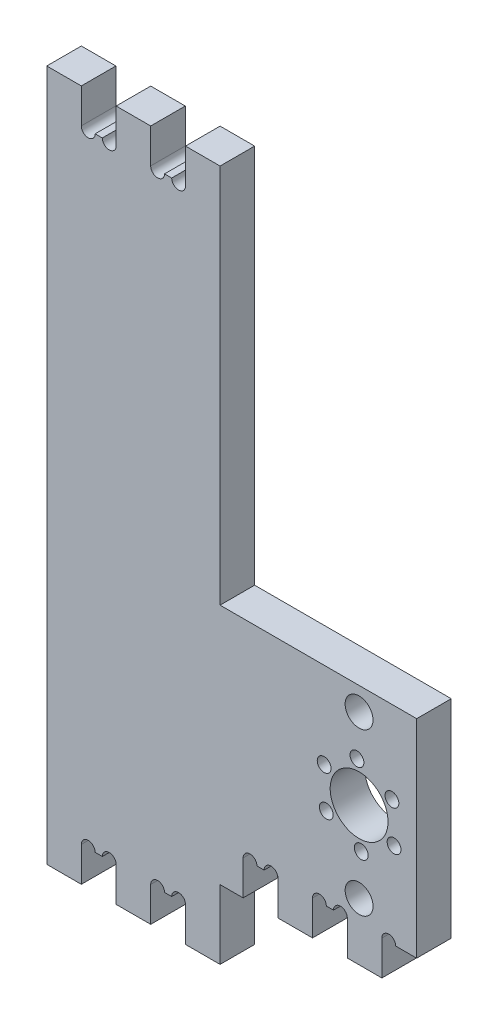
ISO-10303-21;
HEADER;
FILE_DESCRIPTION(('STEP AP214'),'2;1');
FILE_NAME('part.step','',(''),(''),'','','');
FILE_SCHEMA(('AUTOMOTIVE_DESIGN { 1 0 10303 214 1 1 1 1 }'));
ENDSEC;
DATA;
#1=APPLICATION_CONTEXT('core data for automotive mechanical design processes');
#2=APPLICATION_PROTOCOL_DEFINITION('international standard','automotive_design',2000,#1);
#3=PRODUCT_CONTEXT('',#1,'mechanical');
#4=PRODUCT('Part','Part','',(#3));
#5=PRODUCT_RELATED_PRODUCT_CATEGORY('part','',(#4));
#6=PRODUCT_DEFINITION_FORMATION('','',#4);
#7=PRODUCT_DEFINITION_CONTEXT('part definition',#1,'design');
#8=PRODUCT_DEFINITION('design','',#6,#7);
#9=PRODUCT_DEFINITION_SHAPE('','',#8);
#10=(LENGTH_UNIT() NAMED_UNIT(*) SI_UNIT(.MILLI.,.METRE.));
#11=(NAMED_UNIT(*) PLANE_ANGLE_UNIT() SI_UNIT($,.RADIAN.));
#12=(NAMED_UNIT(*) SI_UNIT($,.STERADIAN.) SOLID_ANGLE_UNIT());
#13=UNCERTAINTY_MEASURE_WITH_UNIT(LENGTH_MEASURE(1.E-05),#10,'distance_accuracy_value','');
#14=(GEOMETRIC_REPRESENTATION_CONTEXT(3) GLOBAL_UNCERTAINTY_ASSIGNED_CONTEXT((#13)) GLOBAL_UNIT_ASSIGNED_CONTEXT((#10,
#11,#12)) REPRESENTATION_CONTEXT('',''));
#15=CARTESIAN_POINT('',(0.,0.,0.));
#16=DIRECTION('',(0.,0.,1.));
#17=DIRECTION('',(1.,0.,0.));
#18=AXIS2_PLACEMENT_3D('',#15,#16,#17);
#19=CARTESIAN_POINT('',(14.6792850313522,-45.,15.));
#20=DIRECTION('',(0.,1.,0.));
#21=DIRECTION('',(0.,0.,1.));
#22=AXIS2_PLACEMENT_3D('',#19,#20,#21);
#23=PLANE('',#22);
#24=DIRECTION('',(1.,0.,0.));
#25=VECTOR('',#24,1.);
#26=CARTESIAN_POINT('',(14.6792850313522,-45.,0.));
#27=LINE('',#26,#25);
#28=CARTESIAN_POINT('',(-0.320714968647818,-45.,0.));
#29=VERTEX_POINT('',#28);
#30=CARTESIAN_POINT('',(14.6792850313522,-45.,0.));
#31=VERTEX_POINT('',#30);
#32=EDGE_CURVE('E367',#29,#31,#27,.T.);
#33=ORIENTED_EDGE('',*,*,#32,.T.);
#34=DIRECTION('',(0.,0.,-1.));
#35=VECTOR('',#34,1.);
#36=CARTESIAN_POINT('',(14.6792850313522,-45.,15.));
#37=LINE('',#36,#35);
#38=CARTESIAN_POINT('',(14.6792850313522,-45.,15.));
#39=VERTEX_POINT('',#38);
#40=EDGE_CURVE('E11',#39,#31,#37,.T.);
#41=ORIENTED_EDGE('',*,*,#40,.F.);
#42=DIRECTION('',(1.,0.,0.));
#43=VECTOR('',#42,1.);
#44=CARTESIAN_POINT('',(14.6792850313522,-45.,15.));
#45=LINE('',#44,#43);
#46=CARTESIAN_POINT('',(-0.320714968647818,-45.,15.));
#47=VERTEX_POINT('',#46);
#48=EDGE_CURVE('E462',#47,#39,#45,.T.);
#49=ORIENTED_EDGE('',*,*,#48,.F.);
#50=DIRECTION('',(0.,0.,-1.));
#51=VECTOR('',#50,1.);
#52=CARTESIAN_POINT('',(-0.320714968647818,-45.,15.));
#53=LINE('',#52,#51);
#54=EDGE_CURVE('E363',#47,#29,#53,.T.);
#55=ORIENTED_EDGE('',*,*,#54,.T.);
#56=EDGE_LOOP('',(#33,#41,#49,#55));
#57=FACE_BOUND('',#56,.T.);
#58=ADVANCED_FACE('F37',(#57),#23,.F.);
#59=CARTESIAN_POINT('',(14.6792850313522,-15.,15.));
#60=DIRECTION('',(-1.,0.,0.));
#61=DIRECTION('',(0.,-1.,0.));
#62=AXIS2_PLACEMENT_3D('',#59,#60,#61);
#63=PLANE('',#62);
#64=DIRECTION('',(0.,1.,0.));
#65=VECTOR('',#64,1.);
#66=CARTESIAN_POINT('',(14.6792850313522,-15.,0.));
#67=LINE('',#66,#65);
#68=CARTESIAN_POINT('',(14.6792850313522,-15.,0.));
#69=VERTEX_POINT('',#68);
#70=EDGE_CURVE('E370',#31,#69,#67,.T.);
#71=ORIENTED_EDGE('',*,*,#70,.T.);
#72=DIRECTION('',(0.,0.,-1.));
#73=VECTOR('',#72,1.);
#74=CARTESIAN_POINT('',(14.6792850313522,-15.,15.));
#75=LINE('',#74,#73);
#76=CARTESIAN_POINT('',(14.6792850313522,-15.,15.));
#77=VERTEX_POINT('',#76);
#78=EDGE_CURVE('E45',#77,#69,#75,.T.);
#79=ORIENTED_EDGE('',*,*,#78,.F.);
#80=DIRECTION('',(0.,1.,0.));
#81=VECTOR('',#80,1.);
#82=CARTESIAN_POINT('',(14.6792850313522,-40.,15.));
#83=LINE('',#82,#81);
#84=EDGE_CURVE('E213',#39,#77,#83,.T.);
#85=ORIENTED_EDGE('',*,*,#84,.F.);
#86=ORIENTED_EDGE('',*,*,#40,.T.);
#87=EDGE_LOOP('',(#71,#79,#85,#86));
#88=FACE_BOUND('',#87,.T.);
#89=ADVANCED_FACE('F716',(#88),#63,.F.);
#90=CARTESIAN_POINT('',(24.6792850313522,-15.,15.));
#91=DIRECTION('',(0.,1.,0.));
#92=DIRECTION('',(-1.,0.,0.));
#93=AXIS2_PLACEMENT_3D('',#90,#91,#92);
#94=PLANE('',#93);
#95=DIRECTION('',(1.,0.,0.));
#96=VECTOR('',#95,1.);
#97=CARTESIAN_POINT('',(24.6792850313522,-15.,0.));
#98=LINE('',#97,#96);
#99=CARTESIAN_POINT('',(24.6792850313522,-15.,0.));
#100=VERTEX_POINT('',#99);
#101=EDGE_CURVE('E373',#69,#100,#98,.T.);
#102=ORIENTED_EDGE('',*,*,#101,.T.);
#103=DIRECTION('',(0.,0.,-1.));
#104=VECTOR('',#103,1.);
#105=CARTESIAN_POINT('',(24.6792850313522,-15.,15.));
#106=LINE('',#105,#104);
#107=CARTESIAN_POINT('',(24.6792850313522,-15.,15.));
#108=VERTEX_POINT('',#107);
#109=EDGE_CURVE('E586',#108,#100,#106,.T.);
#110=ORIENTED_EDGE('',*,*,#109,.F.);
#111=DIRECTION('',(1.,0.,0.));
#112=VECTOR('',#111,1.);
#113=CARTESIAN_POINT('',(24.6792850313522,-15.,15.));
#114=LINE('',#113,#112);
#115=EDGE_CURVE('E594',#77,#108,#114,.T.);
#116=ORIENTED_EDGE('',*,*,#115,.F.);
#117=ORIENTED_EDGE('',*,*,#78,.T.);
#118=EDGE_LOOP('',(#102,#110,#116,#117));
#119=FACE_BOUND('',#118,.T.);
#120=ADVANCED_FACE('F592',(#119),#94,.F.);
#121=CARTESIAN_POINT('',(24.6792850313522,0.,15.));
#122=DIRECTION('',(-1.,0.,0.));
#123=DIRECTION('',(0.,-1.,0.));
#124=AXIS2_PLACEMENT_3D('',#121,#122,#123);
#125=PLANE('',#124);
#126=DIRECTION('',(0.,1.,0.));
#127=VECTOR('',#126,1.);
#128=CARTESIAN_POINT('',(24.6792850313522,0.,0.));
#129=LINE('',#128,#127);
#130=CARTESIAN_POINT('',(24.6792850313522,0.,0.));
#131=VERTEX_POINT('',#130);
#132=EDGE_CURVE('E375',#100,#131,#129,.T.);
#133=ORIENTED_EDGE('',*,*,#132,.T.);
#134=DIRECTION('',(0.,0.,-1.));
#135=VECTOR('',#134,1.);
#136=CARTESIAN_POINT('',(24.6792850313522,0.,15.));
#137=LINE('',#136,#135);
#138=CARTESIAN_POINT('',(24.6792850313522,0.,15.));
#139=VERTEX_POINT('',#138);
#140=EDGE_CURVE('E583',#139,#131,#137,.T.);
#141=ORIENTED_EDGE('',*,*,#140,.F.);
#142=DIRECTION('',(0.,1.,0.));
#143=VECTOR('',#142,1.);
#144=CARTESIAN_POINT('',(24.6792850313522,0.,15.));
#145=LINE('',#144,#143);
#146=EDGE_CURVE('E612',#108,#139,#145,.T.);
#147=ORIENTED_EDGE('',*,*,#146,.F.);
#148=ORIENTED_EDGE('',*,*,#109,.T.);
#149=EDGE_LOOP('',(#133,#141,#147,#148));
#150=FACE_BOUND('',#149,.T.);
#151=ADVANCED_FACE('F603',(#150),#125,.F.);
#152=CARTESIAN_POINT('',(27.6792850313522,0.,15.));
#153=DIRECTION('',(0.,0.,-1.));
#154=DIRECTION('',(-1.,0.,0.));
#155=AXIS2_PLACEMENT_3D('',#152,#153,#154);
#156=CYLINDRICAL_SURFACE('',#155,3.);
#157=CARTESIAN_POINT('',(27.6792850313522,0.,0.));
#158=DIRECTION('',(0.,0.,-1.));
#159=DIRECTION('',(-1.,0.,0.));
#160=AXIS2_PLACEMENT_3D('',#157,#158,#159);
#161=CIRCLE('',#160,3.);
#162=CARTESIAN_POINT('',(30.6792850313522,0.,0.));
#163=VERTEX_POINT('',#162);
#164=EDGE_CURVE('E377',#131,#163,#161,.T.);
#165=ORIENTED_EDGE('',*,*,#164,.T.);
#166=DIRECTION('',(0.,0.,-1.));
#167=VECTOR('',#166,1.);
#168=CARTESIAN_POINT('',(30.6792850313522,0.,15.));
#169=LINE('',#168,#167);
#170=CARTESIAN_POINT('',(30.6792850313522,0.,15.));
#171=VERTEX_POINT('',#170);
#172=EDGE_CURVE('E580',#171,#163,#169,.T.);
#173=ORIENTED_EDGE('',*,*,#172,.F.);
#174=CARTESIAN_POINT('',(27.6792850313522,0.,15.));
#175=DIRECTION('',(0.,0.,-1.));
#176=DIRECTION('',(-1.,0.,0.));
#177=AXIS2_PLACEMENT_3D('',#174,#175,#176);
#178=CIRCLE('',#177,3.);
#179=EDGE_CURVE('E609',#139,#171,#178,.T.);
#180=ORIENTED_EDGE('',*,*,#179,.F.);
#181=ORIENTED_EDGE('',*,*,#140,.T.);
#182=EDGE_LOOP('',(#165,#173,#180,#181));
#183=FACE_BOUND('',#182,.T.);
#184=ADVANCED_FACE('F607',(#183),#156,.F.);
#185=CARTESIAN_POINT('',(33.7792850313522,0.,15.));
#186=DIRECTION('',(0.,1.,0.));
#187=DIRECTION('',(-1.,0.,0.));
#188=AXIS2_PLACEMENT_3D('',#185,#186,#187);
#189=PLANE('',#188);
#190=DIRECTION('',(1.,0.,0.));
#191=VECTOR('',#190,1.);
#192=CARTESIAN_POINT('',(33.7792850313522,0.,0.));
#193=LINE('',#192,#191);
#194=CARTESIAN_POINT('',(33.7792850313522,0.,0.));
#195=VERTEX_POINT('',#194);
#196=EDGE_CURVE('E379',#163,#195,#193,.T.);
#197=ORIENTED_EDGE('',*,*,#196,.T.);
#198=DIRECTION('',(0.,0.,-1.));
#199=VECTOR('',#198,1.);
#200=CARTESIAN_POINT('',(33.7792850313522,0.,15.));
#201=LINE('',#200,#199);
#202=CARTESIAN_POINT('',(33.7792850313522,0.,15.));
#203=VERTEX_POINT('',#202);
#204=EDGE_CURVE('E577',#203,#195,#201,.T.);
#205=ORIENTED_EDGE('',*,*,#204,.F.);
#206=DIRECTION('',(1.,0.,0.));
#207=VECTOR('',#206,1.);
#208=CARTESIAN_POINT('',(33.7792850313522,0.,15.));
#209=LINE('',#208,#207);
#210=EDGE_CURVE('E611',#171,#203,#209,.T.);
#211=ORIENTED_EDGE('',*,*,#210,.F.);
#212=ORIENTED_EDGE('',*,*,#172,.T.);
#213=EDGE_LOOP('',(#197,#205,#211,#212));
#214=FACE_BOUND('',#213,.T.);
#215=ADVANCED_FACE('F729',(#214),#189,.F.);
#216=CARTESIAN_POINT('',(36.7792850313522,0.,15.));
#217=DIRECTION('',(0.,0.,-1.));
#218=DIRECTION('',(-1.,0.,0.));
#219=AXIS2_PLACEMENT_3D('',#216,#217,#218);
#220=CYLINDRICAL_SURFACE('',#219,3.);
#221=CARTESIAN_POINT('',(36.7792850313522,0.,0.));
#222=DIRECTION('',(0.,0.,-1.));
#223=DIRECTION('',(-1.,0.,0.));
#224=AXIS2_PLACEMENT_3D('',#221,#222,#223);
#225=CIRCLE('',#224,3.);
#226=CARTESIAN_POINT('',(39.7792850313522,0.,0.));
#227=VERTEX_POINT('',#226);
#228=EDGE_CURVE('E381',#195,#227,#225,.T.);
#229=ORIENTED_EDGE('',*,*,#228,.T.);
#230=DIRECTION('',(0.,0.,-1.));
#231=VECTOR('',#230,1.);
#232=CARTESIAN_POINT('',(39.7792850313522,0.,15.));
#233=LINE('',#232,#231);
#234=CARTESIAN_POINT('',(39.7792850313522,0.,15.));
#235=VERTEX_POINT('',#234);
#236=EDGE_CURVE('E574',#235,#227,#233,.T.);
#237=ORIENTED_EDGE('',*,*,#236,.F.);
#238=CARTESIAN_POINT('',(36.7792850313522,0.,15.));
#239=DIRECTION('',(0.,0.,-1.));
#240=DIRECTION('',(-1.,0.,0.));
#241=AXIS2_PLACEMENT_3D('',#238,#239,#240);
#242=CIRCLE('',#241,3.);
#243=EDGE_CURVE('E614',#203,#235,#242,.T.);
#244=ORIENTED_EDGE('',*,*,#243,.F.);
#245=ORIENTED_EDGE('',*,*,#204,.T.);
#246=EDGE_LOOP('',(#229,#237,#244,#245));
#247=FACE_BOUND('',#246,.T.);
#248=ADVANCED_FACE('F732',(#247),#220,.F.);
#249=CARTESIAN_POINT('',(39.7792850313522,-15.,15.));
#250=DIRECTION('',(1.,0.,0.));
#251=DIRECTION('',(0.,1.,0.));
#252=AXIS2_PLACEMENT_3D('',#249,#250,#251);
#253=PLANE('',#252);
#254=DIRECTION('',(0.,-1.,0.));
#255=VECTOR('',#254,1.);
#256=CARTESIAN_POINT('',(39.7792850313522,-15.,0.));
#257=LINE('',#256,#255);
#258=CARTESIAN_POINT('',(39.7792850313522,-15.,0.));
#259=VERTEX_POINT('',#258);
#260=EDGE_CURVE('E383',#227,#259,#257,.T.);
#261=ORIENTED_EDGE('',*,*,#260,.T.);
#262=DIRECTION('',(0.,0.,-1.));
#263=VECTOR('',#262,1.);
#264=CARTESIAN_POINT('',(39.7792850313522,-15.,15.));
#265=LINE('',#264,#263);
#266=CARTESIAN_POINT('',(39.7792850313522,-15.,15.));
#267=VERTEX_POINT('',#266);
#268=EDGE_CURVE('E571',#267,#259,#265,.T.);
#269=ORIENTED_EDGE('',*,*,#268,.F.);
#270=DIRECTION('',(0.,-1.,0.));
#271=VECTOR('',#270,1.);
#272=CARTESIAN_POINT('',(39.7792850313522,-15.,15.));
#273=LINE('',#272,#271);
#274=EDGE_CURVE('E620',#235,#267,#273,.T.);
#275=ORIENTED_EDGE('',*,*,#274,.F.);
#276=ORIENTED_EDGE('',*,*,#236,.T.);
#277=EDGE_LOOP('',(#261,#269,#275,#276));
#278=FACE_BOUND('',#277,.T.);
#279=ADVANCED_FACE('F736',(#278),#253,.F.);
#280=CARTESIAN_POINT('',(54.7792850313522,-15.,15.));
#281=DIRECTION('',(0.,1.,0.));
#282=DIRECTION('',(-1.,0.,0.));
#283=AXIS2_PLACEMENT_3D('',#280,#281,#282);
#284=PLANE('',#283);
#285=DIRECTION('',(1.,0.,0.));
#286=VECTOR('',#285,1.);
#287=CARTESIAN_POINT('',(54.7792850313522,-15.,0.));
#288=LINE('',#287,#286);
#289=CARTESIAN_POINT('',(54.7792850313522,-15.,0.));
#290=VERTEX_POINT('',#289);
#291=EDGE_CURVE('E385',#259,#290,#288,.T.);
#292=ORIENTED_EDGE('',*,*,#291,.T.);
#293=DIRECTION('',(0.,0.,-1.));
#294=VECTOR('',#293,1.);
#295=CARTESIAN_POINT('',(54.7792850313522,-15.,15.));
#296=LINE('',#295,#294);
#297=CARTESIAN_POINT('',(54.7792850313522,-15.,15.));
#298=VERTEX_POINT('',#297);
#299=EDGE_CURVE('E568',#298,#290,#296,.T.);
#300=ORIENTED_EDGE('',*,*,#299,.F.);
#301=DIRECTION('',(1.,0.,0.));
#302=VECTOR('',#301,1.);
#303=CARTESIAN_POINT('',(54.7792850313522,-15.,15.));
#304=LINE('',#303,#302);
#305=EDGE_CURVE('E622',#267,#298,#304,.T.);
#306=ORIENTED_EDGE('',*,*,#305,.F.);
#307=ORIENTED_EDGE('',*,*,#268,.T.);
#308=EDGE_LOOP('',(#292,#300,#306,#307));
#309=FACE_BOUND('',#308,.T.);
#310=ADVANCED_FACE('F740',(#309),#284,.F.);
#311=CARTESIAN_POINT('',(54.7792850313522,0.,15.));
#312=DIRECTION('',(-1.,0.,0.));
#313=DIRECTION('',(0.,-1.,0.));
#314=AXIS2_PLACEMENT_3D('',#311,#312,#313);
#315=PLANE('',#314);
#316=DIRECTION('',(0.,1.,0.));
#317=VECTOR('',#316,1.);
#318=CARTESIAN_POINT('',(54.7792850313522,0.,0.));
#319=LINE('',#318,#317);
#320=CARTESIAN_POINT('',(54.7792850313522,0.,0.));
#321=VERTEX_POINT('',#320);
#322=EDGE_CURVE('E387',#290,#321,#319,.T.);
#323=ORIENTED_EDGE('',*,*,#322,.T.);
#324=DIRECTION('',(0.,0.,-1.));
#325=VECTOR('',#324,1.);
#326=CARTESIAN_POINT('',(54.7792850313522,0.,15.));
#327=LINE('',#326,#325);
#328=CARTESIAN_POINT('',(54.7792850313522,0.,15.));
#329=VERTEX_POINT('',#328);
#330=EDGE_CURVE('E565',#329,#321,#327,.T.);
#331=ORIENTED_EDGE('',*,*,#330,.F.);
#332=DIRECTION('',(0.,1.,0.));
#333=VECTOR('',#332,1.);
#334=CARTESIAN_POINT('',(54.7792850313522,0.,15.));
#335=LINE('',#334,#333);
#336=EDGE_CURVE('E624',#298,#329,#335,.T.);
#337=ORIENTED_EDGE('',*,*,#336,.F.);
#338=ORIENTED_EDGE('',*,*,#299,.T.);
#339=EDGE_LOOP('',(#323,#331,#337,#338));
#340=FACE_BOUND('',#339,.T.);
#341=ADVANCED_FACE('F744',(#340),#315,.F.);
#342=CARTESIAN_POINT('',(57.7792850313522,0.,15.));
#343=DIRECTION('',(0.,0.,-1.));
#344=DIRECTION('',(-1.,0.,0.));
#345=AXIS2_PLACEMENT_3D('',#342,#343,#344);
#346=CYLINDRICAL_SURFACE('',#345,3.00000000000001);
#347=CARTESIAN_POINT('',(57.7792850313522,0.,0.));
#348=DIRECTION('',(0.,0.,-1.));
#349=DIRECTION('',(-1.,0.,0.));
#350=AXIS2_PLACEMENT_3D('',#347,#348,#349);
#351=CIRCLE('',#350,3.00000000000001);
#352=CARTESIAN_POINT('',(60.7792850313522,0.,0.));
#353=VERTEX_POINT('',#352);
#354=EDGE_CURVE('E389',#321,#353,#351,.T.);
#355=ORIENTED_EDGE('',*,*,#354,.T.);
#356=DIRECTION('',(0.,0.,-1.));
#357=VECTOR('',#356,1.);
#358=CARTESIAN_POINT('',(60.7792850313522,0.,15.));
#359=LINE('',#358,#357);
#360=CARTESIAN_POINT('',(60.7792850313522,0.,15.));
#361=VERTEX_POINT('',#360);
#362=EDGE_CURVE('E562',#361,#353,#359,.T.);
#363=ORIENTED_EDGE('',*,*,#362,.F.);
#364=CARTESIAN_POINT('',(57.7792850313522,0.,15.));
#365=DIRECTION('',(0.,0.,-1.));
#366=DIRECTION('',(-1.,0.,0.));
#367=AXIS2_PLACEMENT_3D('',#364,#365,#366);
#368=CIRCLE('',#367,3.00000000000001);
#369=EDGE_CURVE('E626',#329,#361,#368,.T.);
#370=ORIENTED_EDGE('',*,*,#369,.F.);
#371=ORIENTED_EDGE('',*,*,#330,.T.);
#372=EDGE_LOOP('',(#355,#363,#370,#371));
#373=FACE_BOUND('',#372,.T.);
#374=ADVANCED_FACE('F748',(#373),#346,.F.);
#375=CARTESIAN_POINT('',(63.8792850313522,0.,15.));
#376=DIRECTION('',(0.,1.,0.));
#377=DIRECTION('',(-1.,0.,0.));
#378=AXIS2_PLACEMENT_3D('',#375,#376,#377);
#379=PLANE('',#378);
#380=DIRECTION('',(1.,0.,0.));
#381=VECTOR('',#380,1.);
#382=CARTESIAN_POINT('',(63.8792850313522,0.,0.));
#383=LINE('',#382,#381);
#384=CARTESIAN_POINT('',(63.8792850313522,0.,0.));
#385=VERTEX_POINT('',#384);
#386=EDGE_CURVE('E391',#353,#385,#383,.T.);
#387=ORIENTED_EDGE('',*,*,#386,.T.);
#388=DIRECTION('',(0.,0.,-1.));
#389=VECTOR('',#388,1.);
#390=CARTESIAN_POINT('',(63.8792850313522,0.,15.));
#391=LINE('',#390,#389);
#392=CARTESIAN_POINT('',(63.8792850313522,0.,15.));
#393=VERTEX_POINT('',#392);
#394=EDGE_CURVE('E559',#393,#385,#391,.T.);
#395=ORIENTED_EDGE('',*,*,#394,.F.);
#396=DIRECTION('',(1.,0.,0.));
#397=VECTOR('',#396,1.);
#398=CARTESIAN_POINT('',(63.8792850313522,0.,15.));
#399=LINE('',#398,#397);
#400=EDGE_CURVE('E628',#361,#393,#399,.T.);
#401=ORIENTED_EDGE('',*,*,#400,.F.);
#402=ORIENTED_EDGE('',*,*,#362,.T.);
#403=EDGE_LOOP('',(#387,#395,#401,#402));
#404=FACE_BOUND('',#403,.T.);
#405=ADVANCED_FACE('F752',(#404),#379,.F.);
#406=CARTESIAN_POINT('',(66.8792850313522,0.,15.));
#407=DIRECTION('',(0.,0.,-1.));
#408=DIRECTION('',(-1.,0.,0.));
#409=AXIS2_PLACEMENT_3D('',#406,#407,#408);
#410=CYLINDRICAL_SURFACE('',#409,3.);
#411=CARTESIAN_POINT('',(66.8792850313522,0.,0.));
#412=DIRECTION('',(0.,0.,-1.));
#413=DIRECTION('',(-1.,0.,0.));
#414=AXIS2_PLACEMENT_3D('',#411,#412,#413);
#415=CIRCLE('',#414,3.);
#416=CARTESIAN_POINT('',(69.8792850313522,0.,0.));
#417=VERTEX_POINT('',#416);
#418=EDGE_CURVE('E393',#385,#417,#415,.T.);
#419=ORIENTED_EDGE('',*,*,#418,.T.);
#420=DIRECTION('',(0.,0.,-1.));
#421=VECTOR('',#420,1.);
#422=CARTESIAN_POINT('',(69.8792850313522,0.,15.));
#423=LINE('',#422,#421);
#424=CARTESIAN_POINT('',(69.8792850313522,0.,15.));
#425=VERTEX_POINT('',#424);
#426=EDGE_CURVE('E556',#425,#417,#423,.T.);
#427=ORIENTED_EDGE('',*,*,#426,.F.);
#428=CARTESIAN_POINT('',(66.8792850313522,0.,15.));
#429=DIRECTION('',(0.,0.,-1.));
#430=DIRECTION('',(-1.,0.,0.));
#431=AXIS2_PLACEMENT_3D('',#428,#429,#430);
#432=CIRCLE('',#431,3.);
#433=EDGE_CURVE('E630',#393,#425,#432,.T.);
#434=ORIENTED_EDGE('',*,*,#433,.F.);
#435=ORIENTED_EDGE('',*,*,#394,.T.);
#436=EDGE_LOOP('',(#419,#427,#434,#435));
#437=FACE_BOUND('',#436,.T.);
#438=ADVANCED_FACE('F756',(#437),#410,.F.);
#439=CARTESIAN_POINT('',(69.8792850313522,-15.,15.));
#440=DIRECTION('',(1.,0.,0.));
#441=DIRECTION('',(0.,1.,0.));
#442=AXIS2_PLACEMENT_3D('',#439,#440,#441);
#443=PLANE('',#442);
#444=DIRECTION('',(0.,-1.,0.));
#445=VECTOR('',#444,1.);
#446=CARTESIAN_POINT('',(69.8792850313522,-15.,0.));
#447=LINE('',#446,#445);
#448=CARTESIAN_POINT('',(69.8792850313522,-15.,0.));
#449=VERTEX_POINT('',#448);
#450=EDGE_CURVE('E395',#417,#449,#447,.T.);
#451=ORIENTED_EDGE('',*,*,#450,.T.);
#452=DIRECTION('',(0.,0.,-1.));
#453=VECTOR('',#452,1.);
#454=CARTESIAN_POINT('',(69.8792850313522,-15.,15.));
#455=LINE('',#454,#453);
#456=CARTESIAN_POINT('',(69.8792850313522,-15.,15.));
#457=VERTEX_POINT('',#456);
#458=EDGE_CURVE('E553',#457,#449,#455,.T.);
#459=ORIENTED_EDGE('',*,*,#458,.F.);
#460=DIRECTION('',(0.,-1.,0.));
#461=VECTOR('',#460,1.);
#462=CARTESIAN_POINT('',(69.8792850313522,-15.,15.));
#463=LINE('',#462,#461);
#464=EDGE_CURVE('E632',#425,#457,#463,.T.);
#465=ORIENTED_EDGE('',*,*,#464,.F.);
#466=ORIENTED_EDGE('',*,*,#426,.T.);
#467=EDGE_LOOP('',(#451,#459,#465,#466));
#468=FACE_BOUND('',#467,.T.);
#469=ADVANCED_FACE('F760',(#468),#443,.F.);
#470=CARTESIAN_POINT('',(84.8792850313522,-15.,15.));
#471=DIRECTION('',(0.,1.,0.));
#472=DIRECTION('',(-1.,0.,0.));
#473=AXIS2_PLACEMENT_3D('',#470,#471,#472);
#474=PLANE('',#473);
#475=DIRECTION('',(1.,0.,0.));
#476=VECTOR('',#475,1.);
#477=CARTESIAN_POINT('',(84.8792850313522,-15.,0.));
#478=LINE('',#477,#476);
#479=CARTESIAN_POINT('',(84.8792850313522,-15.,0.));
#480=VERTEX_POINT('',#479);
#481=EDGE_CURVE('E397',#449,#480,#478,.T.);
#482=ORIENTED_EDGE('',*,*,#481,.T.);
#483=DIRECTION('',(0.,0.,-1.));
#484=VECTOR('',#483,1.);
#485=CARTESIAN_POINT('',(84.8792850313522,-15.,15.));
#486=LINE('',#485,#484);
#487=CARTESIAN_POINT('',(84.8792850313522,-15.,15.));
#488=VERTEX_POINT('',#487);
#489=EDGE_CURVE('E550',#488,#480,#486,.T.);
#490=ORIENTED_EDGE('',*,*,#489,.F.);
#491=DIRECTION('',(1.,0.,0.));
#492=VECTOR('',#491,1.);
#493=CARTESIAN_POINT('',(84.8792850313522,-15.,15.));
#494=LINE('',#493,#492);
#495=EDGE_CURVE('E634',#457,#488,#494,.T.);
#496=ORIENTED_EDGE('',*,*,#495,.F.);
#497=ORIENTED_EDGE('',*,*,#458,.T.);
#498=EDGE_LOOP('',(#482,#490,#496,#497));
#499=FACE_BOUND('',#498,.T.);
#500=ADVANCED_FACE('F764',(#499),#474,.F.);
#501=CARTESIAN_POINT('',(84.8792850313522,0.,15.));
#502=DIRECTION('',(-1.,0.,0.));
#503=DIRECTION('',(0.,-1.,0.));
#504=AXIS2_PLACEMENT_3D('',#501,#502,#503);
#505=PLANE('',#504);
#506=DIRECTION('',(0.,1.,0.));
#507=VECTOR('',#506,1.);
#508=CARTESIAN_POINT('',(84.8792850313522,0.,0.));
#509=LINE('',#508,#507);
#510=CARTESIAN_POINT('',(84.8792850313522,0.,0.));
#511=VERTEX_POINT('',#510);
#512=EDGE_CURVE('E399',#480,#511,#509,.T.);
#513=ORIENTED_EDGE('',*,*,#512,.T.);
#514=DIRECTION('',(0.,0.,-1.));
#515=VECTOR('',#514,1.);
#516=CARTESIAN_POINT('',(84.8792850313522,0.,15.));
#517=LINE('',#516,#515);
#518=CARTESIAN_POINT('',(84.8792850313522,0.,15.));
#519=VERTEX_POINT('',#518);
#520=EDGE_CURVE('E547',#519,#511,#517,.T.);
#521=ORIENTED_EDGE('',*,*,#520,.F.);
#522=DIRECTION('',(0.,1.,0.));
#523=VECTOR('',#522,1.);
#524=CARTESIAN_POINT('',(84.8792850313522,0.,15.));
#525=LINE('',#524,#523);
#526=EDGE_CURVE('E636',#488,#519,#525,.T.);
#527=ORIENTED_EDGE('',*,*,#526,.F.);
#528=ORIENTED_EDGE('',*,*,#489,.T.);
#529=EDGE_LOOP('',(#513,#521,#527,#528));
#530=FACE_BOUND('',#529,.T.);
#531=ADVANCED_FACE('F768',(#530),#505,.F.);
#532=CARTESIAN_POINT('',(87.8792850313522,0.,15.));
#533=DIRECTION('',(0.,0.,-1.));
#534=DIRECTION('',(-1.,0.,0.));
#535=AXIS2_PLACEMENT_3D('',#532,#533,#534);
#536=CYLINDRICAL_SURFACE('',#535,3.);
#537=CARTESIAN_POINT('',(87.8792850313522,0.,0.));
#538=DIRECTION('',(0.,0.,-1.));
#539=DIRECTION('',(1.,0.,0.));
#540=AXIS2_PLACEMENT_3D('',#537,#538,#539);
#541=CIRCLE('',#540,3.);
#542=CARTESIAN_POINT('',(90.8792850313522,0.,0.));
#543=VERTEX_POINT('',#542);
#544=EDGE_CURVE('E401',#511,#543,#541,.T.);
#545=ORIENTED_EDGE('',*,*,#544,.T.);
#546=DIRECTION('',(0.,0.,-1.));
#547=VECTOR('',#546,1.);
#548=CARTESIAN_POINT('',(90.8792850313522,0.,15.));
#549=LINE('',#548,#547);
#550=CARTESIAN_POINT('',(90.8792850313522,0.,15.));
#551=VERTEX_POINT('',#550);
#552=EDGE_CURVE('E544',#551,#543,#549,.T.);
#553=ORIENTED_EDGE('',*,*,#552,.F.);
#554=CARTESIAN_POINT('',(87.8792850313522,0.,15.));
#555=DIRECTION('',(0.,0.,-1.));
#556=DIRECTION('',(1.,0.,0.));
#557=AXIS2_PLACEMENT_3D('',#554,#555,#556);
#558=CIRCLE('',#557,3.);
#559=EDGE_CURVE('E638',#519,#551,#558,.T.);
#560=ORIENTED_EDGE('',*,*,#559,.F.);
#561=ORIENTED_EDGE('',*,*,#520,.T.);
#562=EDGE_LOOP('',(#545,#553,#560,#561));
#563=FACE_BOUND('',#562,.T.);
#564=ADVANCED_FACE('F772',(#563),#536,.F.);
#565=CARTESIAN_POINT('',(99.9792850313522,0.,15.));
#566=DIRECTION('',(0.,1.,0.));
#567=DIRECTION('',(-1.,0.,0.));
#568=AXIS2_PLACEMENT_3D('',#565,#566,#567);
#569=PLANE('',#568);
#570=DIRECTION('',(1.,0.,0.));
#571=VECTOR('',#570,1.);
#572=CARTESIAN_POINT('',(99.9792850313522,0.,0.));
#573=LINE('',#572,#571);
#574=CARTESIAN_POINT('',(99.9792850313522,0.,0.));
#575=VERTEX_POINT('',#574);
#576=EDGE_CURVE('E403',#543,#575,#573,.T.);
#577=ORIENTED_EDGE('',*,*,#576,.T.);
#578=DIRECTION('',(0.,0.,-1.));
#579=VECTOR('',#578,1.);
#580=CARTESIAN_POINT('',(99.9792850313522,0.,15.));
#581=LINE('',#580,#579);
#582=CARTESIAN_POINT('',(99.9792850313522,0.,15.));
#583=VERTEX_POINT('',#582);
#584=EDGE_CURVE('E541',#583,#575,#581,.T.);
#585=ORIENTED_EDGE('',*,*,#584,.F.);
#586=DIRECTION('',(1.,0.,0.));
#587=VECTOR('',#586,1.);
#588=CARTESIAN_POINT('',(99.9792850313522,0.,15.));
#589=LINE('',#588,#587);
#590=EDGE_CURVE('E640',#551,#583,#589,.T.);
#591=ORIENTED_EDGE('',*,*,#590,.F.);
#592=ORIENTED_EDGE('',*,*,#552,.T.);
#593=EDGE_LOOP('',(#577,#585,#591,#592));
#594=FACE_BOUND('',#593,.T.);
#595=ADVANCED_FACE('F776',(#594),#569,.F.);
#596=CARTESIAN_POINT('',(99.9792850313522,90.,15.));
#597=DIRECTION('',(-1.,0.,0.));
#598=DIRECTION('',(0.,-1.,0.));
#599=AXIS2_PLACEMENT_3D('',#596,#597,#598);
#600=PLANE('',#599);
#601=DIRECTION('',(0.,1.,0.));
#602=VECTOR('',#601,1.);
#603=CARTESIAN_POINT('',(99.9792850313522,90.,0.));
#604=LINE('',#603,#602);
#605=CARTESIAN_POINT('',(99.9792850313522,90.,0.));
#606=VERTEX_POINT('',#605);
#607=EDGE_CURVE('E405',#575,#606,#604,.T.);
#608=ORIENTED_EDGE('',*,*,#607,.T.);
#609=DIRECTION('',(0.,0.,-1.));
#610=VECTOR('',#609,1.);
#611=CARTESIAN_POINT('',(99.9792850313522,90.,15.));
#612=LINE('',#611,#610);
#613=CARTESIAN_POINT('',(99.9792850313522,90.,15.));
#614=VERTEX_POINT('',#613);
#615=EDGE_CURVE('E538',#614,#606,#612,.T.);
#616=ORIENTED_EDGE('',*,*,#615,.F.);
#617=DIRECTION('',(0.,1.,0.));
#618=VECTOR('',#617,1.);
#619=CARTESIAN_POINT('',(99.9792850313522,90.,15.));
#620=LINE('',#619,#618);
#621=EDGE_CURVE('E642',#583,#614,#620,.T.);
#622=ORIENTED_EDGE('',*,*,#621,.F.);
#623=ORIENTED_EDGE('',*,*,#584,.T.);
#624=EDGE_LOOP('',(#608,#616,#622,#623));
#625=FACE_BOUND('',#624,.T.);
#626=ADVANCED_FACE('F780',(#625),#600,.F.);
#627=CARTESIAN_POINT('',(14.6792850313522,90.,15.));
#628=DIRECTION('',(0.,-1.,0.));
#629=DIRECTION('',(0.,0.,-1.));
#630=AXIS2_PLACEMENT_3D('',#627,#628,#629);
#631=PLANE('',#630);
#632=DIRECTION('',(-1.,0.,0.));
#633=VECTOR('',#632,1.);
#634=CARTESIAN_POINT('',(14.6792850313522,90.,0.));
#635=LINE('',#634,#633);
#636=CARTESIAN_POINT('',(14.6792850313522,90.,0.));
#637=VERTEX_POINT('',#636);
#638=EDGE_CURVE('E407',#606,#637,#635,.T.);
#639=ORIENTED_EDGE('',*,*,#638,.T.);
#640=DIRECTION('',(0.,0.,-1.));
#641=VECTOR('',#640,1.);
#642=CARTESIAN_POINT('',(14.6792850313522,90.,15.));
#643=LINE('',#642,#641);
#644=CARTESIAN_POINT('',(14.6792850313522,90.,15.));
#645=VERTEX_POINT('',#644);
#646=EDGE_CURVE('E535',#645,#637,#643,.T.);
#647=ORIENTED_EDGE('',*,*,#646,.F.);
#648=DIRECTION('',(-1.,0.,0.));
#649=VECTOR('',#648,1.);
#650=CARTESIAN_POINT('',(14.6792850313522,90.,15.));
#651=LINE('',#650,#649);
#652=EDGE_CURVE('E644',#614,#645,#651,.T.);
#653=ORIENTED_EDGE('',*,*,#652,.F.);
#654=ORIENTED_EDGE('',*,*,#615,.T.);
#655=EDGE_LOOP('',(#639,#647,#653,#654));
#656=FACE_BOUND('',#655,.T.);
#657=ADVANCED_FACE('F784',(#656),#631,.F.);
#658=CARTESIAN_POINT('',(14.6792850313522,255.,15.));
#659=DIRECTION('',(-1.,0.,0.));
#660=DIRECTION('',(0.,-1.,0.));
#661=AXIS2_PLACEMENT_3D('',#658,#659,#660);
#662=PLANE('',#661);
#663=DIRECTION('',(0.,1.,0.));
#664=VECTOR('',#663,1.);
#665=CARTESIAN_POINT('',(14.6792850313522,255.,0.));
#666=LINE('',#665,#664);
#667=CARTESIAN_POINT('',(14.6792850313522,255.,0.));
#668=VERTEX_POINT('',#667);
#669=EDGE_CURVE('E410',#637,#668,#666,.T.);
#670=ORIENTED_EDGE('',*,*,#669,.T.);
#671=DIRECTION('',(0.,0.,-1.));
#672=VECTOR('',#671,1.);
#673=CARTESIAN_POINT('',(14.6792850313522,255.,15.));
#674=LINE('',#673,#672);
#675=CARTESIAN_POINT('',(14.6792850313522,255.,15.));
#676=VERTEX_POINT('',#675);
#677=EDGE_CURVE('E532',#676,#668,#674,.T.);
#678=ORIENTED_EDGE('',*,*,#677,.F.);
#679=DIRECTION('',(0.,1.,0.));
#680=VECTOR('',#679,1.);
#681=CARTESIAN_POINT('',(14.6792850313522,240.,15.));
#682=LINE('',#681,#680);
#683=EDGE_CURVE('E646',#645,#676,#682,.T.);
#684=ORIENTED_EDGE('',*,*,#683,.F.);
#685=ORIENTED_EDGE('',*,*,#646,.T.);
#686=EDGE_LOOP('',(#670,#678,#684,#685));
#687=FACE_BOUND('',#686,.T.);
#688=ADVANCED_FACE('F788',(#687),#662,.F.);
#689=CARTESIAN_POINT('',(-0.320714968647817,255.,15.));
#690=DIRECTION('',(0.,-1.,0.));
#691=DIRECTION('',(0.,0.,-1.));
#692=AXIS2_PLACEMENT_3D('',#689,#690,#691);
#693=PLANE('',#692);
#694=DIRECTION('',(-1.,0.,0.));
#695=VECTOR('',#694,1.);
#696=CARTESIAN_POINT('',(-0.320714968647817,255.,0.));
#697=LINE('',#696,#695);
#698=CARTESIAN_POINT('',(-0.320714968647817,255.,0.));
#699=VERTEX_POINT('',#698);
#700=EDGE_CURVE('E412',#668,#699,#697,.T.);
#701=ORIENTED_EDGE('',*,*,#700,.T.);
#702=DIRECTION('',(0.,0.,-1.));
#703=VECTOR('',#702,1.);
#704=CARTESIAN_POINT('',(-0.320714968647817,255.,15.));
#705=LINE('',#704,#703);
#706=CARTESIAN_POINT('',(-0.320714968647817,255.,15.));
#707=VERTEX_POINT('',#706);
#708=EDGE_CURVE('E529',#707,#699,#705,.T.);
#709=ORIENTED_EDGE('',*,*,#708,.F.);
#710=DIRECTION('',(-1.,0.,0.));
#711=VECTOR('',#710,1.);
#712=CARTESIAN_POINT('',(-0.320714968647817,255.,15.));
#713=LINE('',#712,#711);
#714=EDGE_CURVE('E648',#676,#707,#713,.T.);
#715=ORIENTED_EDGE('',*,*,#714,.F.);
#716=ORIENTED_EDGE('',*,*,#677,.T.);
#717=EDGE_LOOP('',(#701,#709,#715,#716));
#718=FACE_BOUND('',#717,.T.);
#719=ADVANCED_FACE('F792',(#718),#693,.F.);
#720=CARTESIAN_POINT('',(-0.320714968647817,240.,15.));
#721=DIRECTION('',(1.,0.,0.));
#722=DIRECTION('',(0.,1.,0.));
#723=AXIS2_PLACEMENT_3D('',#720,#721,#722);
#724=PLANE('',#723);
#725=DIRECTION('',(0.,-1.,0.));
#726=VECTOR('',#725,1.);
#727=CARTESIAN_POINT('',(-0.320714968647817,240.,0.));
#728=LINE('',#727,#726);
#729=CARTESIAN_POINT('',(-0.320714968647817,240.,0.));
#730=VERTEX_POINT('',#729);
#731=EDGE_CURVE('E414',#699,#730,#728,.T.);
#732=ORIENTED_EDGE('',*,*,#731,.T.);
#733=DIRECTION('',(0.,0.,-1.));
#734=VECTOR('',#733,1.);
#735=CARTESIAN_POINT('',(-0.320714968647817,240.,15.));
#736=LINE('',#735,#734);
#737=CARTESIAN_POINT('',(-0.320714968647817,240.,15.));
#738=VERTEX_POINT('',#737);
#739=EDGE_CURVE('E526',#738,#730,#736,.T.);
#740=ORIENTED_EDGE('',*,*,#739,.F.);
#741=DIRECTION('',(0.,-1.,0.));
#742=VECTOR('',#741,1.);
#743=CARTESIAN_POINT('',(-0.320714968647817,240.,15.));
#744=LINE('',#743,#742);
#745=EDGE_CURVE('E650',#707,#738,#744,.T.);
#746=ORIENTED_EDGE('',*,*,#745,.F.);
#747=ORIENTED_EDGE('',*,*,#708,.T.);
#748=EDGE_LOOP('',(#732,#740,#746,#747));
#749=FACE_BOUND('',#748,.T.);
#750=ADVANCED_FACE('F796',(#749),#724,.F.);
#751=CARTESIAN_POINT('',(-3.32071496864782,240.,15.));
#752=DIRECTION('',(0.,0.,-1.));
#753=DIRECTION('',(-1.,0.,0.));
#754=AXIS2_PLACEMENT_3D('',#751,#752,#753);
#755=CYLINDRICAL_SURFACE('',#754,3.);
#756=CARTESIAN_POINT('',(-3.32071496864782,240.,0.));
#757=DIRECTION('',(0.,0.,-1.));
#758=DIRECTION('',(1.,0.,0.));
#759=AXIS2_PLACEMENT_3D('',#756,#757,#758);
#760=CIRCLE('',#759,3.);
#761=CARTESIAN_POINT('',(-6.32071496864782,240.,0.));
#762=VERTEX_POINT('',#761);
#763=EDGE_CURVE('E416',#730,#762,#760,.T.);
#764=ORIENTED_EDGE('',*,*,#763,.T.);
#765=DIRECTION('',(0.,0.,-1.));
#766=VECTOR('',#765,1.);
#767=CARTESIAN_POINT('',(-6.32071496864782,240.,15.));
#768=LINE('',#767,#766);
#769=CARTESIAN_POINT('',(-6.32071496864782,240.,15.));
#770=VERTEX_POINT('',#769);
#771=EDGE_CURVE('E523',#770,#762,#768,.T.);
#772=ORIENTED_EDGE('',*,*,#771,.F.);
#773=CARTESIAN_POINT('',(-3.32071496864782,240.,15.));
#774=DIRECTION('',(0.,0.,-1.));
#775=DIRECTION('',(1.,0.,0.));
#776=AXIS2_PLACEMENT_3D('',#773,#774,#775);
#777=CIRCLE('',#776,3.);
#778=EDGE_CURVE('E652',#738,#770,#777,.T.);
#779=ORIENTED_EDGE('',*,*,#778,.F.);
#780=ORIENTED_EDGE('',*,*,#739,.T.);
#781=EDGE_LOOP('',(#764,#772,#779,#780));
#782=FACE_BOUND('',#781,.T.);
#783=ADVANCED_FACE('F800',(#782),#755,.F.);
#784=CARTESIAN_POINT('',(-9.42071496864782,240.,15.));
#785=DIRECTION('',(0.,-1.,0.));
#786=DIRECTION('',(0.,0.,-1.));
#787=AXIS2_PLACEMENT_3D('',#784,#785,#786);
#788=PLANE('',#787);
#789=DIRECTION('',(-1.,0.,0.));
#790=VECTOR('',#789,1.);
#791=CARTESIAN_POINT('',(-9.42071496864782,240.,0.));
#792=LINE('',#791,#790);
#793=CARTESIAN_POINT('',(-9.42071496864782,240.,0.));
#794=VERTEX_POINT('',#793);
#795=EDGE_CURVE('E418',#762,#794,#792,.T.);
#796=ORIENTED_EDGE('',*,*,#795,.T.);
#797=DIRECTION('',(0.,0.,-1.));
#798=VECTOR('',#797,1.);
#799=CARTESIAN_POINT('',(-9.42071496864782,240.,15.));
#800=LINE('',#799,#798);
#801=CARTESIAN_POINT('',(-9.42071496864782,240.,15.));
#802=VERTEX_POINT('',#801);
#803=EDGE_CURVE('E520',#802,#794,#800,.T.);
#804=ORIENTED_EDGE('',*,*,#803,.F.);
#805=DIRECTION('',(-1.,0.,0.));
#806=VECTOR('',#805,1.);
#807=CARTESIAN_POINT('',(-9.42071496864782,240.,15.));
#808=LINE('',#807,#806);
#809=EDGE_CURVE('E654',#770,#802,#808,.T.);
#810=ORIENTED_EDGE('',*,*,#809,.F.);
#811=ORIENTED_EDGE('',*,*,#771,.T.);
#812=EDGE_LOOP('',(#796,#804,#810,#811));
#813=FACE_BOUND('',#812,.T.);
#814=ADVANCED_FACE('F804',(#813),#788,.F.);
#815=CARTESIAN_POINT('',(-12.4207149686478,240.,15.));
#816=DIRECTION('',(0.,0.,-1.));
#817=DIRECTION('',(-1.,0.,0.));
#818=AXIS2_PLACEMENT_3D('',#815,#816,#817);
#819=CYLINDRICAL_SURFACE('',#818,3.);
#820=CARTESIAN_POINT('',(-12.4207149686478,240.,0.));
#821=DIRECTION('',(0.,0.,-1.));
#822=DIRECTION('',(1.,0.,0.));
#823=AXIS2_PLACEMENT_3D('',#820,#821,#822);
#824=CIRCLE('',#823,3.);
#825=CARTESIAN_POINT('',(-15.4207149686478,240.,0.));
#826=VERTEX_POINT('',#825);
#827=EDGE_CURVE('E420',#794,#826,#824,.T.);
#828=ORIENTED_EDGE('',*,*,#827,.T.);
#829=DIRECTION('',(0.,0.,-1.));
#830=VECTOR('',#829,1.);
#831=CARTESIAN_POINT('',(-15.4207149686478,240.,15.));
#832=LINE('',#831,#830);
#833=CARTESIAN_POINT('',(-15.4207149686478,240.,15.));
#834=VERTEX_POINT('',#833);
#835=EDGE_CURVE('E517',#834,#826,#832,.T.);
#836=ORIENTED_EDGE('',*,*,#835,.F.);
#837=CARTESIAN_POINT('',(-12.4207149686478,240.,15.));
#838=DIRECTION('',(0.,0.,-1.));
#839=DIRECTION('',(1.,0.,0.));
#840=AXIS2_PLACEMENT_3D('',#837,#838,#839);
#841=CIRCLE('',#840,3.);
#842=EDGE_CURVE('E656',#802,#834,#841,.T.);
#843=ORIENTED_EDGE('',*,*,#842,.F.);
#844=ORIENTED_EDGE('',*,*,#803,.T.);
#845=EDGE_LOOP('',(#828,#836,#843,#844));
#846=FACE_BOUND('',#845,.T.);
#847=ADVANCED_FACE('F808',(#846),#819,.F.);
#848=CARTESIAN_POINT('',(-15.4207149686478,255.,15.));
#849=DIRECTION('',(-1.,0.,0.));
#850=DIRECTION('',(0.,-1.,0.));
#851=AXIS2_PLACEMENT_3D('',#848,#849,#850);
#852=PLANE('',#851);
#853=DIRECTION('',(0.,1.,0.));
#854=VECTOR('',#853,1.);
#855=CARTESIAN_POINT('',(-15.4207149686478,255.,0.));
#856=LINE('',#855,#854);
#857=CARTESIAN_POINT('',(-15.4207149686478,255.,0.));
#858=VERTEX_POINT('',#857);
#859=EDGE_CURVE('E422',#826,#858,#856,.T.);
#860=ORIENTED_EDGE('',*,*,#859,.T.);
#861=DIRECTION('',(0.,0.,-1.));
#862=VECTOR('',#861,1.);
#863=CARTESIAN_POINT('',(-15.4207149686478,255.,15.));
#864=LINE('',#863,#862);
#865=CARTESIAN_POINT('',(-15.4207149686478,255.,15.));
#866=VERTEX_POINT('',#865);
#867=EDGE_CURVE('E514',#866,#858,#864,.T.);
#868=ORIENTED_EDGE('',*,*,#867,.F.);
#869=DIRECTION('',(0.,1.,0.));
#870=VECTOR('',#869,1.);
#871=CARTESIAN_POINT('',(-15.4207149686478,255.,15.));
#872=LINE('',#871,#870);
#873=EDGE_CURVE('E658',#834,#866,#872,.T.);
#874=ORIENTED_EDGE('',*,*,#873,.F.);
#875=ORIENTED_EDGE('',*,*,#835,.T.);
#876=EDGE_LOOP('',(#860,#868,#874,#875));
#877=FACE_BOUND('',#876,.T.);
#878=ADVANCED_FACE('F812',(#877),#852,.F.);
#879=CARTESIAN_POINT('',(-30.4207149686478,255.,15.));
#880=DIRECTION('',(0.,-1.,0.));
#881=DIRECTION('',(0.,0.,-1.));
#882=AXIS2_PLACEMENT_3D('',#879,#880,#881);
#883=PLANE('',#882);
#884=DIRECTION('',(-1.,0.,0.));
#885=VECTOR('',#884,1.);
#886=CARTESIAN_POINT('',(-30.4207149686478,255.,0.));
#887=LINE('',#886,#885);
#888=CARTESIAN_POINT('',(-30.4207149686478,255.,0.));
#889=VERTEX_POINT('',#888);
#890=EDGE_CURVE('E424',#858,#889,#887,.T.);
#891=ORIENTED_EDGE('',*,*,#890,.T.);
#892=DIRECTION('',(0.,0.,-1.));
#893=VECTOR('',#892,1.);
#894=CARTESIAN_POINT('',(-30.4207149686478,255.,15.));
#895=LINE('',#894,#893);
#896=CARTESIAN_POINT('',(-30.4207149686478,255.,15.));
#897=VERTEX_POINT('',#896);
#898=EDGE_CURVE('E511',#897,#889,#895,.T.);
#899=ORIENTED_EDGE('',*,*,#898,.F.);
#900=DIRECTION('',(-1.,0.,0.));
#901=VECTOR('',#900,1.);
#902=CARTESIAN_POINT('',(-30.4207149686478,255.,15.));
#903=LINE('',#902,#901);
#904=EDGE_CURVE('E660',#866,#897,#903,.T.);
#905=ORIENTED_EDGE('',*,*,#904,.F.);
#906=ORIENTED_EDGE('',*,*,#867,.T.);
#907=EDGE_LOOP('',(#891,#899,#905,#906));
#908=FACE_BOUND('',#907,.T.);
#909=ADVANCED_FACE('F816',(#908),#883,.F.);
#910=CARTESIAN_POINT('',(-30.4207149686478,240.,15.));
#911=DIRECTION('',(1.,0.,0.));
#912=DIRECTION('',(0.,1.,0.));
#913=AXIS2_PLACEMENT_3D('',#910,#911,#912);
#914=PLANE('',#913);
#915=DIRECTION('',(0.,-1.,0.));
#916=VECTOR('',#915,1.);
#917=CARTESIAN_POINT('',(-30.4207149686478,240.,0.));
#918=LINE('',#917,#916);
#919=CARTESIAN_POINT('',(-30.4207149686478,240.,0.));
#920=VERTEX_POINT('',#919);
#921=EDGE_CURVE('E426',#889,#920,#918,.T.);
#922=ORIENTED_EDGE('',*,*,#921,.T.);
#923=DIRECTION('',(0.,0.,-1.));
#924=VECTOR('',#923,1.);
#925=CARTESIAN_POINT('',(-30.4207149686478,240.,15.));
#926=LINE('',#925,#924);
#927=CARTESIAN_POINT('',(-30.4207149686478,240.,15.));
#928=VERTEX_POINT('',#927);
#929=EDGE_CURVE('E508',#928,#920,#926,.T.);
#930=ORIENTED_EDGE('',*,*,#929,.F.);
#931=DIRECTION('',(0.,-1.,0.));
#932=VECTOR('',#931,1.);
#933=CARTESIAN_POINT('',(-30.4207149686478,240.,15.));
#934=LINE('',#933,#932);
#935=EDGE_CURVE('E662',#897,#928,#934,.T.);
#936=ORIENTED_EDGE('',*,*,#935,.F.);
#937=ORIENTED_EDGE('',*,*,#898,.T.);
#938=EDGE_LOOP('',(#922,#930,#936,#937));
#939=FACE_BOUND('',#938,.T.);
#940=ADVANCED_FACE('F820',(#939),#914,.F.);
#941=CARTESIAN_POINT('',(-33.4207149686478,240.,15.));
#942=DIRECTION('',(0.,0.,-1.));
#943=DIRECTION('',(-1.,0.,0.));
#944=AXIS2_PLACEMENT_3D('',#941,#942,#943);
#945=CYLINDRICAL_SURFACE('',#944,3.);
#946=CARTESIAN_POINT('',(-33.4207149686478,240.,0.));
#947=DIRECTION('',(0.,0.,-1.));
#948=DIRECTION('',(1.,0.,0.));
#949=AXIS2_PLACEMENT_3D('',#946,#947,#948);
#950=CIRCLE('',#949,3.);
#951=CARTESIAN_POINT('',(-36.4207149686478,240.,0.));
#952=VERTEX_POINT('',#951);
#953=EDGE_CURVE('E428',#920,#952,#950,.T.);
#954=ORIENTED_EDGE('',*,*,#953,.T.);
#955=DIRECTION('',(0.,0.,-1.));
#956=VECTOR('',#955,1.);
#957=CARTESIAN_POINT('',(-36.4207149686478,240.,15.));
#958=LINE('',#957,#956);
#959=CARTESIAN_POINT('',(-36.4207149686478,240.,15.));
#960=VERTEX_POINT('',#959);
#961=EDGE_CURVE('E505',#960,#952,#958,.T.);
#962=ORIENTED_EDGE('',*,*,#961,.F.);
#963=CARTESIAN_POINT('',(-33.4207149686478,240.,15.));
#964=DIRECTION('',(0.,0.,-1.));
#965=DIRECTION('',(1.,0.,0.));
#966=AXIS2_PLACEMENT_3D('',#963,#964,#965);
#967=CIRCLE('',#966,3.);
#968=EDGE_CURVE('E664',#928,#960,#967,.T.);
#969=ORIENTED_EDGE('',*,*,#968,.F.);
#970=ORIENTED_EDGE('',*,*,#929,.T.);
#971=EDGE_LOOP('',(#954,#962,#969,#970));
#972=FACE_BOUND('',#971,.T.);
#973=ADVANCED_FACE('F824',(#972),#945,.F.);
#974=CARTESIAN_POINT('',(-39.5207149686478,240.,15.));
#975=DIRECTION('',(0.,-1.,0.));
#976=DIRECTION('',(1.,0.,0.));
#977=AXIS2_PLACEMENT_3D('',#974,#975,#976);
#978=PLANE('',#977);
#979=DIRECTION('',(-1.,0.,0.));
#980=VECTOR('',#979,1.);
#981=CARTESIAN_POINT('',(-39.5207149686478,240.,0.));
#982=LINE('',#981,#980);
#983=CARTESIAN_POINT('',(-39.5207149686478,240.,0.));
#984=VERTEX_POINT('',#983);
#985=EDGE_CURVE('E430',#952,#984,#982,.T.);
#986=ORIENTED_EDGE('',*,*,#985,.T.);
#987=DIRECTION('',(0.,0.,-1.));
#988=VECTOR('',#987,1.);
#989=CARTESIAN_POINT('',(-39.5207149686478,240.,15.));
#990=LINE('',#989,#988);
#991=CARTESIAN_POINT('',(-39.5207149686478,240.,15.));
#992=VERTEX_POINT('',#991);
#993=EDGE_CURVE('E502',#992,#984,#990,.T.);
#994=ORIENTED_EDGE('',*,*,#993,.F.);
#995=DIRECTION('',(-1.,0.,0.));
#996=VECTOR('',#995,1.);
#997=CARTESIAN_POINT('',(-39.5207149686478,240.,15.));
#998=LINE('',#997,#996);
#999=EDGE_CURVE('E666',#960,#992,#998,.T.);
#1000=ORIENTED_EDGE('',*,*,#999,.F.);
#1001=ORIENTED_EDGE('',*,*,#961,.T.);
#1002=EDGE_LOOP('',(#986,#994,#1000,#1001));
#1003=FACE_BOUND('',#1002,.T.);
#1004=ADVANCED_FACE('F828',(#1003),#978,.F.);
#1005=CARTESIAN_POINT('',(-42.5207149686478,240.,15.));
#1006=DIRECTION('',(0.,0.,-1.));
#1007=DIRECTION('',(-1.,0.,0.));
#1008=AXIS2_PLACEMENT_3D('',#1005,#1006,#1007);
#1009=CYLINDRICAL_SURFACE('',#1008,3.);
#1010=CARTESIAN_POINT('',(-42.5207149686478,240.,0.));
#1011=DIRECTION('',(0.,0.,-1.));
#1012=DIRECTION('',(1.,0.,0.));
#1013=AXIS2_PLACEMENT_3D('',#1010,#1011,#1012);
#1014=CIRCLE('',#1013,3.);
#1015=CARTESIAN_POINT('',(-45.5207149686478,240.,0.));
#1016=VERTEX_POINT('',#1015);
#1017=EDGE_CURVE('E432',#984,#1016,#1014,.T.);
#1018=ORIENTED_EDGE('',*,*,#1017,.T.);
#1019=DIRECTION('',(0.,0.,-1.));
#1020=VECTOR('',#1019,1.);
#1021=CARTESIAN_POINT('',(-45.5207149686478,240.,15.));
#1022=LINE('',#1021,#1020);
#1023=CARTESIAN_POINT('',(-45.5207149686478,240.,15.));
#1024=VERTEX_POINT('',#1023);
#1025=EDGE_CURVE('E499',#1024,#1016,#1022,.T.);
#1026=ORIENTED_EDGE('',*,*,#1025,.F.);
#1027=CARTESIAN_POINT('',(-42.5207149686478,240.,15.));
#1028=DIRECTION('',(0.,0.,-1.));
#1029=DIRECTION('',(1.,0.,0.));
#1030=AXIS2_PLACEMENT_3D('',#1027,#1028,#1029);
#1031=CIRCLE('',#1030,3.);
#1032=EDGE_CURVE('E668',#992,#1024,#1031,.T.);
#1033=ORIENTED_EDGE('',*,*,#1032,.F.);
#1034=ORIENTED_EDGE('',*,*,#993,.T.);
#1035=EDGE_LOOP('',(#1018,#1026,#1033,#1034));
#1036=FACE_BOUND('',#1035,.T.);
#1037=ADVANCED_FACE('F832',(#1036),#1009,.F.);
#1038=CARTESIAN_POINT('',(-45.5207149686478,255.,15.));
#1039=DIRECTION('',(-1.,0.,0.));
#1040=DIRECTION('',(0.,-1.,0.));
#1041=AXIS2_PLACEMENT_3D('',#1038,#1039,#1040);
#1042=PLANE('',#1041);
#1043=DIRECTION('',(0.,1.,0.));
#1044=VECTOR('',#1043,1.);
#1045=CARTESIAN_POINT('',(-45.5207149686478,255.,0.));
#1046=LINE('',#1045,#1044);
#1047=CARTESIAN_POINT('',(-45.5207149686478,255.,0.));
#1048=VERTEX_POINT('',#1047);
#1049=EDGE_CURVE('E434',#1016,#1048,#1046,.T.);
#1050=ORIENTED_EDGE('',*,*,#1049,.T.);
#1051=DIRECTION('',(0.,0.,-1.));
#1052=VECTOR('',#1051,1.);
#1053=CARTESIAN_POINT('',(-45.5207149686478,255.,15.));
#1054=LINE('',#1053,#1052);
#1055=CARTESIAN_POINT('',(-45.5207149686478,255.,15.));
#1056=VERTEX_POINT('',#1055);
#1057=EDGE_CURVE('E496',#1056,#1048,#1054,.T.);
#1058=ORIENTED_EDGE('',*,*,#1057,.F.);
#1059=DIRECTION('',(0.,1.,0.));
#1060=VECTOR('',#1059,1.);
#1061=CARTESIAN_POINT('',(-45.5207149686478,255.,15.));
#1062=LINE('',#1061,#1060);
#1063=EDGE_CURVE('E670',#1024,#1056,#1062,.T.);
#1064=ORIENTED_EDGE('',*,*,#1063,.F.);
#1065=ORIENTED_EDGE('',*,*,#1025,.T.);
#1066=EDGE_LOOP('',(#1050,#1058,#1064,#1065));
#1067=FACE_BOUND('',#1066,.T.);
#1068=ADVANCED_FACE('F836',(#1067),#1042,.F.);
#1069=CARTESIAN_POINT('',(-60.5207149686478,255.,15.));
#1070=DIRECTION('',(0.,-1.,0.));
#1071=DIRECTION('',(0.,0.,-1.));
#1072=AXIS2_PLACEMENT_3D('',#1069,#1070,#1071);
#1073=PLANE('',#1072);
#1074=DIRECTION('',(-1.,0.,0.));
#1075=VECTOR('',#1074,1.);
#1076=CARTESIAN_POINT('',(-60.5207149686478,255.,0.));
#1077=LINE('',#1076,#1075);
#1078=CARTESIAN_POINT('',(-60.5207149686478,255.,0.));
#1079=VERTEX_POINT('',#1078);
#1080=EDGE_CURVE('E436',#1048,#1079,#1077,.T.);
#1081=ORIENTED_EDGE('',*,*,#1080,.T.);
#1082=DIRECTION('',(0.,0.,-1.));
#1083=VECTOR('',#1082,1.);
#1084=CARTESIAN_POINT('',(-60.5207149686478,255.,15.));
#1085=LINE('',#1084,#1083);
#1086=CARTESIAN_POINT('',(-60.5207149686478,255.,15.));
#1087=VERTEX_POINT('',#1086);
#1088=EDGE_CURVE('E493',#1087,#1079,#1085,.T.);
#1089=ORIENTED_EDGE('',*,*,#1088,.F.);
#1090=DIRECTION('',(-1.,0.,0.));
#1091=VECTOR('',#1090,1.);
#1092=CARTESIAN_POINT('',(-60.5207149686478,255.,15.));
#1093=LINE('',#1092,#1091);
#1094=EDGE_CURVE('E672',#1056,#1087,#1093,.T.);
#1095=ORIENTED_EDGE('',*,*,#1094,.F.);
#1096=ORIENTED_EDGE('',*,*,#1057,.T.);
#1097=EDGE_LOOP('',(#1081,#1089,#1095,#1096));
#1098=FACE_BOUND('',#1097,.T.);
#1099=ADVANCED_FACE('F840',(#1098),#1073,.F.);
#1100=CARTESIAN_POINT('',(-60.5207149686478,-45.,15.));
#1101=DIRECTION('',(1.,0.,0.));
#1102=DIRECTION('',(0.,0.,-1.));
#1103=AXIS2_PLACEMENT_3D('',#1100,#1101,#1102);
#1104=PLANE('',#1103);
#1105=DIRECTION('',(0.,-1.,0.));
#1106=VECTOR('',#1105,1.);
#1107=CARTESIAN_POINT('',(-60.5207149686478,-45.,0.));
#1108=LINE('',#1107,#1106);
#1109=CARTESIAN_POINT('',(-60.5207149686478,-45.,0.));
#1110=VERTEX_POINT('',#1109);
#1111=EDGE_CURVE('E439',#1079,#1110,#1108,.T.);
#1112=ORIENTED_EDGE('',*,*,#1111,.T.);
#1113=DIRECTION('',(0.,0.,-1.));
#1114=VECTOR('',#1113,1.);
#1115=CARTESIAN_POINT('',(-60.5207149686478,-45.,15.));
#1116=LINE('',#1115,#1114);
#1117=CARTESIAN_POINT('',(-60.5207149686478,-45.,15.));
#1118=VERTEX_POINT('',#1117);
#1119=EDGE_CURVE('E490',#1118,#1110,#1116,.T.);
#1120=ORIENTED_EDGE('',*,*,#1119,.F.);
#1121=DIRECTION('',(0.,-1.,0.));
#1122=VECTOR('',#1121,1.);
#1123=CARTESIAN_POINT('',(-60.5207149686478,160.,15.));
#1124=LINE('',#1123,#1122);
#1125=EDGE_CURVE('E674',#1087,#1118,#1124,.T.);
#1126=ORIENTED_EDGE('',*,*,#1125,.F.);
#1127=ORIENTED_EDGE('',*,*,#1088,.T.);
#1128=EDGE_LOOP('',(#1112,#1120,#1126,#1127));
#1129=FACE_BOUND('',#1128,.T.);
#1130=ADVANCED_FACE('F844',(#1129),#1104,.F.);
#1131=CARTESIAN_POINT('',(-45.5207149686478,-45.,15.));
#1132=DIRECTION('',(0.,1.,0.));
#1133=DIRECTION('',(0.,0.,1.));
#1134=AXIS2_PLACEMENT_3D('',#1131,#1132,#1133);
#1135=PLANE('',#1134);
#1136=DIRECTION('',(1.,0.,0.));
#1137=VECTOR('',#1136,1.);
#1138=CARTESIAN_POINT('',(-45.5207149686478,-45.,0.));
#1139=LINE('',#1138,#1137);
#1140=CARTESIAN_POINT('',(-45.5207149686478,-45.,0.));
#1141=VERTEX_POINT('',#1140);
#1142=EDGE_CURVE('E441',#1110,#1141,#1139,.T.);
#1143=ORIENTED_EDGE('',*,*,#1142,.T.);
#1144=DIRECTION('',(0.,0.,-1.));
#1145=VECTOR('',#1144,1.);
#1146=CARTESIAN_POINT('',(-45.5207149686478,-45.,15.));
#1147=LINE('',#1146,#1145);
#1148=CARTESIAN_POINT('',(-45.5207149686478,-45.,15.));
#1149=VERTEX_POINT('',#1148);
#1150=EDGE_CURVE('E487',#1149,#1141,#1147,.T.);
#1151=ORIENTED_EDGE('',*,*,#1150,.F.);
#1152=DIRECTION('',(1.,0.,0.));
#1153=VECTOR('',#1152,1.);
#1154=CARTESIAN_POINT('',(-45.5207149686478,-45.,15.));
#1155=LINE('',#1154,#1153);
#1156=EDGE_CURVE('E676',#1118,#1149,#1155,.T.);
#1157=ORIENTED_EDGE('',*,*,#1156,.F.);
#1158=ORIENTED_EDGE('',*,*,#1119,.T.);
#1159=EDGE_LOOP('',(#1143,#1151,#1157,#1158));
#1160=FACE_BOUND('',#1159,.T.);
#1161=ADVANCED_FACE('F848',(#1160),#1135,.F.);
#1162=CARTESIAN_POINT('',(-45.5207149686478,-30.,15.));
#1163=DIRECTION('',(-1.,0.,0.));
#1164=DIRECTION('',(0.,0.,1.));
#1165=AXIS2_PLACEMENT_3D('',#1162,#1163,#1164);
#1166=PLANE('',#1165);
#1167=DIRECTION('',(0.,1.,0.));
#1168=VECTOR('',#1167,1.);
#1169=CARTESIAN_POINT('',(-45.5207149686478,-30.,0.));
#1170=LINE('',#1169,#1168);
#1171=CARTESIAN_POINT('',(-45.5207149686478,-30.,0.));
#1172=VERTEX_POINT('',#1171);
#1173=EDGE_CURVE('E443',#1141,#1172,#1170,.T.);
#1174=ORIENTED_EDGE('',*,*,#1173,.T.);
#1175=DIRECTION('',(0.,0.,-1.));
#1176=VECTOR('',#1175,1.);
#1177=CARTESIAN_POINT('',(-45.5207149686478,-30.,15.));
#1178=LINE('',#1177,#1176);
#1179=CARTESIAN_POINT('',(-45.5207149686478,-30.,15.));
#1180=VERTEX_POINT('',#1179);
#1181=EDGE_CURVE('E484',#1180,#1172,#1178,.T.);
#1182=ORIENTED_EDGE('',*,*,#1181,.F.);
#1183=DIRECTION('',(0.,1.,0.));
#1184=VECTOR('',#1183,1.);
#1185=CARTESIAN_POINT('',(-45.5207149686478,-30.,15.));
#1186=LINE('',#1185,#1184);
#1187=EDGE_CURVE('E678',#1149,#1180,#1186,.T.);
#1188=ORIENTED_EDGE('',*,*,#1187,.F.);
#1189=ORIENTED_EDGE('',*,*,#1150,.T.);
#1190=EDGE_LOOP('',(#1174,#1182,#1188,#1189));
#1191=FACE_BOUND('',#1190,.T.);
#1192=ADVANCED_FACE('F852',(#1191),#1166,.F.);
#1193=CARTESIAN_POINT('',(-42.5207149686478,-30.,15.));
#1194=DIRECTION('',(0.,0.,-1.));
#1195=DIRECTION('',(-1.,0.,0.));
#1196=AXIS2_PLACEMENT_3D('',#1193,#1194,#1195);
#1197=CYLINDRICAL_SURFACE('',#1196,3.);
#1198=CARTESIAN_POINT('',(-42.5207149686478,-30.,0.));
#1199=DIRECTION('',(0.,0.,-1.));
#1200=DIRECTION('',(-1.,0.,0.));
#1201=AXIS2_PLACEMENT_3D('',#1198,#1199,#1200);
#1202=CIRCLE('',#1201,3.);
#1203=CARTESIAN_POINT('',(-39.5207149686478,-30.,0.));
#1204=VERTEX_POINT('',#1203);
#1205=EDGE_CURVE('E445',#1172,#1204,#1202,.T.);
#1206=ORIENTED_EDGE('',*,*,#1205,.T.);
#1207=DIRECTION('',(0.,0.,-1.));
#1208=VECTOR('',#1207,1.);
#1209=CARTESIAN_POINT('',(-39.5207149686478,-30.,15.));
#1210=LINE('',#1209,#1208);
#1211=CARTESIAN_POINT('',(-39.5207149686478,-30.,15.));
#1212=VERTEX_POINT('',#1211);
#1213=EDGE_CURVE('E481',#1212,#1204,#1210,.T.);
#1214=ORIENTED_EDGE('',*,*,#1213,.F.);
#1215=CARTESIAN_POINT('',(-42.5207149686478,-30.,15.));
#1216=DIRECTION('',(0.,0.,-1.));
#1217=DIRECTION('',(-1.,0.,0.));
#1218=AXIS2_PLACEMENT_3D('',#1215,#1216,#1217);
#1219=CIRCLE('',#1218,3.);
#1220=EDGE_CURVE('E680',#1180,#1212,#1219,.T.);
#1221=ORIENTED_EDGE('',*,*,#1220,.F.);
#1222=ORIENTED_EDGE('',*,*,#1181,.T.);
#1223=EDGE_LOOP('',(#1206,#1214,#1221,#1222));
#1224=FACE_BOUND('',#1223,.T.);
#1225=ADVANCED_FACE('F856',(#1224),#1197,.F.);
#1226=CARTESIAN_POINT('',(-36.4207149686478,-30.,15.));
#1227=DIRECTION('',(0.,1.,0.));
#1228=DIRECTION('',(-1.,0.,0.));
#1229=AXIS2_PLACEMENT_3D('',#1226,#1227,#1228);
#1230=PLANE('',#1229);
#1231=DIRECTION('',(1.,0.,0.));
#1232=VECTOR('',#1231,1.);
#1233=CARTESIAN_POINT('',(-36.4207149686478,-30.,0.));
#1234=LINE('',#1233,#1232);
#1235=CARTESIAN_POINT('',(-36.4207149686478,-30.,0.));
#1236=VERTEX_POINT('',#1235);
#1237=EDGE_CURVE('E447',#1204,#1236,#1234,.T.);
#1238=ORIENTED_EDGE('',*,*,#1237,.T.);
#1239=DIRECTION('',(0.,0.,-1.));
#1240=VECTOR('',#1239,1.);
#1241=CARTESIAN_POINT('',(-36.4207149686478,-30.,15.));
#1242=LINE('',#1241,#1240);
#1243=CARTESIAN_POINT('',(-36.4207149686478,-30.,15.));
#1244=VERTEX_POINT('',#1243);
#1245=EDGE_CURVE('E478',#1244,#1236,#1242,.T.);
#1246=ORIENTED_EDGE('',*,*,#1245,.F.);
#1247=DIRECTION('',(1.,0.,0.));
#1248=VECTOR('',#1247,1.);
#1249=CARTESIAN_POINT('',(-36.4207149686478,-30.,15.));
#1250=LINE('',#1249,#1248);
#1251=EDGE_CURVE('E682',#1212,#1244,#1250,.T.);
#1252=ORIENTED_EDGE('',*,*,#1251,.F.);
#1253=ORIENTED_EDGE('',*,*,#1213,.T.);
#1254=EDGE_LOOP('',(#1238,#1246,#1252,#1253));
#1255=FACE_BOUND('',#1254,.T.);
#1256=ADVANCED_FACE('F860',(#1255),#1230,.F.);
#1257=CARTESIAN_POINT('',(-33.4207149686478,-30.,15.));
#1258=DIRECTION('',(0.,0.,-1.));
#1259=DIRECTION('',(-1.,0.,0.));
#1260=AXIS2_PLACEMENT_3D('',#1257,#1258,#1259);
#1261=CYLINDRICAL_SURFACE('',#1260,3.);
#1262=CARTESIAN_POINT('',(-33.4207149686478,-30.,0.));
#1263=DIRECTION('',(0.,0.,-1.));
#1264=DIRECTION('',(-1.,0.,0.));
#1265=AXIS2_PLACEMENT_3D('',#1262,#1263,#1264);
#1266=CIRCLE('',#1265,3.);
#1267=CARTESIAN_POINT('',(-30.4207149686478,-30.,0.));
#1268=VERTEX_POINT('',#1267);
#1269=EDGE_CURVE('E449',#1236,#1268,#1266,.T.);
#1270=ORIENTED_EDGE('',*,*,#1269,.T.);
#1271=DIRECTION('',(0.,0.,-1.));
#1272=VECTOR('',#1271,1.);
#1273=CARTESIAN_POINT('',(-30.4207149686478,-30.,15.));
#1274=LINE('',#1273,#1272);
#1275=CARTESIAN_POINT('',(-30.4207149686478,-30.,15.));
#1276=VERTEX_POINT('',#1275);
#1277=EDGE_CURVE('E475',#1276,#1268,#1274,.T.);
#1278=ORIENTED_EDGE('',*,*,#1277,.F.);
#1279=CARTESIAN_POINT('',(-33.4207149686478,-30.,15.));
#1280=DIRECTION('',(0.,0.,-1.));
#1281=DIRECTION('',(-1.,0.,0.));
#1282=AXIS2_PLACEMENT_3D('',#1279,#1280,#1281);
#1283=CIRCLE('',#1282,3.);
#1284=EDGE_CURVE('E684',#1244,#1276,#1283,.T.);
#1285=ORIENTED_EDGE('',*,*,#1284,.F.);
#1286=ORIENTED_EDGE('',*,*,#1245,.T.);
#1287=EDGE_LOOP('',(#1270,#1278,#1285,#1286));
#1288=FACE_BOUND('',#1287,.T.);
#1289=ADVANCED_FACE('F864',(#1288),#1261,.F.);
#1290=CARTESIAN_POINT('',(-30.4207149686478,-45.,15.));
#1291=DIRECTION('',(1.,0.,0.));
#1292=DIRECTION('',(0.,0.,-1.));
#1293=AXIS2_PLACEMENT_3D('',#1290,#1291,#1292);
#1294=PLANE('',#1293);
#1295=DIRECTION('',(0.,-1.,0.));
#1296=VECTOR('',#1295,1.);
#1297=CARTESIAN_POINT('',(-30.4207149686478,-45.,0.));
#1298=LINE('',#1297,#1296);
#1299=CARTESIAN_POINT('',(-30.4207149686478,-45.,0.));
#1300=VERTEX_POINT('',#1299);
#1301=EDGE_CURVE('E451',#1268,#1300,#1298,.T.);
#1302=ORIENTED_EDGE('',*,*,#1301,.T.);
#1303=DIRECTION('',(0.,0.,-1.));
#1304=VECTOR('',#1303,1.);
#1305=CARTESIAN_POINT('',(-30.4207149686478,-45.,15.));
#1306=LINE('',#1305,#1304);
#1307=CARTESIAN_POINT('',(-30.4207149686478,-45.,15.));
#1308=VERTEX_POINT('',#1307);
#1309=EDGE_CURVE('E472',#1308,#1300,#1306,.T.);
#1310=ORIENTED_EDGE('',*,*,#1309,.F.);
#1311=DIRECTION('',(0.,-1.,0.));
#1312=VECTOR('',#1311,1.);
#1313=CARTESIAN_POINT('',(-30.4207149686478,-45.,15.));
#1314=LINE('',#1313,#1312);
#1315=EDGE_CURVE('E686',#1276,#1308,#1314,.T.);
#1316=ORIENTED_EDGE('',*,*,#1315,.F.);
#1317=ORIENTED_EDGE('',*,*,#1277,.T.);
#1318=EDGE_LOOP('',(#1302,#1310,#1316,#1317));
#1319=FACE_BOUND('',#1318,.T.);
#1320=ADVANCED_FACE('F868',(#1319),#1294,.F.);
#1321=CARTESIAN_POINT('',(-15.4207149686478,-45.,15.));
#1322=DIRECTION('',(0.,1.,0.));
#1323=DIRECTION('',(0.,0.,1.));
#1324=AXIS2_PLACEMENT_3D('',#1321,#1322,#1323);
#1325=PLANE('',#1324);
#1326=DIRECTION('',(1.,0.,0.));
#1327=VECTOR('',#1326,1.);
#1328=CARTESIAN_POINT('',(-15.4207149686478,-45.,0.));
#1329=LINE('',#1328,#1327);
#1330=CARTESIAN_POINT('',(-15.4207149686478,-45.,0.));
#1331=VERTEX_POINT('',#1330);
#1332=EDGE_CURVE('E453',#1300,#1331,#1329,.T.);
#1333=ORIENTED_EDGE('',*,*,#1332,.T.);
#1334=DIRECTION('',(0.,0.,-1.));
#1335=VECTOR('',#1334,1.);
#1336=CARTESIAN_POINT('',(-15.4207149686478,-45.,15.));
#1337=LINE('',#1336,#1335);
#1338=CARTESIAN_POINT('',(-15.4207149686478,-45.,15.));
#1339=VERTEX_POINT('',#1338);
#1340=EDGE_CURVE('E469',#1339,#1331,#1337,.T.);
#1341=ORIENTED_EDGE('',*,*,#1340,.F.);
#1342=DIRECTION('',(1.,0.,0.));
#1343=VECTOR('',#1342,1.);
#1344=CARTESIAN_POINT('',(-15.4207149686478,-45.,15.));
#1345=LINE('',#1344,#1343);
#1346=EDGE_CURVE('E688',#1308,#1339,#1345,.T.);
#1347=ORIENTED_EDGE('',*,*,#1346,.F.);
#1348=ORIENTED_EDGE('',*,*,#1309,.T.);
#1349=EDGE_LOOP('',(#1333,#1341,#1347,#1348));
#1350=FACE_BOUND('',#1349,.T.);
#1351=ADVANCED_FACE('F872',(#1350),#1325,.F.);
#1352=CARTESIAN_POINT('',(-15.4207149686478,-30.,15.));
#1353=DIRECTION('',(-1.,0.,0.));
#1354=DIRECTION('',(0.,-1.,0.));
#1355=AXIS2_PLACEMENT_3D('',#1352,#1353,#1354);
#1356=PLANE('',#1355);
#1357=DIRECTION('',(0.,1.,0.));
#1358=VECTOR('',#1357,1.);
#1359=CARTESIAN_POINT('',(-15.4207149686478,-30.,0.));
#1360=LINE('',#1359,#1358);
#1361=CARTESIAN_POINT('',(-15.4207149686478,-30.,0.));
#1362=VERTEX_POINT('',#1361);
#1363=EDGE_CURVE('E455',#1331,#1362,#1360,.T.);
#1364=ORIENTED_EDGE('',*,*,#1363,.T.);
#1365=DIRECTION('',(0.,0.,-1.));
#1366=VECTOR('',#1365,1.);
#1367=CARTESIAN_POINT('',(-15.4207149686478,-30.,15.));
#1368=LINE('',#1367,#1366);
#1369=CARTESIAN_POINT('',(-15.4207149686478,-30.,15.));
#1370=VERTEX_POINT('',#1369);
#1371=EDGE_CURVE('E466',#1370,#1362,#1368,.T.);
#1372=ORIENTED_EDGE('',*,*,#1371,.F.);
#1373=DIRECTION('',(0.,1.,0.));
#1374=VECTOR('',#1373,1.);
#1375=CARTESIAN_POINT('',(-15.4207149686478,-30.,15.));
#1376=LINE('',#1375,#1374);
#1377=EDGE_CURVE('E690',#1339,#1370,#1376,.T.);
#1378=ORIENTED_EDGE('',*,*,#1377,.F.);
#1379=ORIENTED_EDGE('',*,*,#1340,.T.);
#1380=EDGE_LOOP('',(#1364,#1372,#1378,#1379));
#1381=FACE_BOUND('',#1380,.T.);
#1382=ADVANCED_FACE('F696',(#1381),#1356,.F.);
#1383=CARTESIAN_POINT('',(-12.4207149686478,-30.,15.));
#1384=DIRECTION('',(0.,0.,-1.));
#1385=DIRECTION('',(-1.,0.,0.));
#1386=AXIS2_PLACEMENT_3D('',#1383,#1384,#1385);
#1387=CYLINDRICAL_SURFACE('',#1386,3.);
#1388=CARTESIAN_POINT('',(-12.4207149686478,-30.,0.));
#1389=DIRECTION('',(0.,0.,-1.));
#1390=DIRECTION('',(-1.,0.,0.));
#1391=AXIS2_PLACEMENT_3D('',#1388,#1389,#1390);
#1392=CIRCLE('',#1391,3.);
#1393=CARTESIAN_POINT('',(-9.42071496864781,-30.,0.));
#1394=VERTEX_POINT('',#1393);
#1395=EDGE_CURVE('E457',#1362,#1394,#1392,.T.);
#1396=ORIENTED_EDGE('',*,*,#1395,.T.);
#1397=DIRECTION('',(0.,0.,-1.));
#1398=VECTOR('',#1397,1.);
#1399=CARTESIAN_POINT('',(-9.42071496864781,-30.,15.));
#1400=LINE('',#1399,#1398);
#1401=CARTESIAN_POINT('',(-9.42071496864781,-30.,15.));
#1402=VERTEX_POINT('',#1401);
#1403=EDGE_CURVE('E358',#1402,#1394,#1400,.T.);
#1404=ORIENTED_EDGE('',*,*,#1403,.F.);
#1405=CARTESIAN_POINT('',(-12.4207149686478,-30.,15.));
#1406=DIRECTION('',(0.,0.,-1.));
#1407=DIRECTION('',(-1.,0.,0.));
#1408=AXIS2_PLACEMENT_3D('',#1405,#1406,#1407);
#1409=CIRCLE('',#1408,3.);
#1410=EDGE_CURVE('E349',#1370,#1402,#1409,.T.);
#1411=ORIENTED_EDGE('',*,*,#1410,.F.);
#1412=ORIENTED_EDGE('',*,*,#1371,.T.);
#1413=EDGE_LOOP('',(#1396,#1404,#1411,#1412));
#1414=FACE_BOUND('',#1413,.T.);
#1415=ADVANCED_FACE('F700',(#1414),#1387,.F.);
#1416=CARTESIAN_POINT('',(-6.32071496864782,-30.,15.));
#1417=DIRECTION('',(0.,1.,0.));
#1418=DIRECTION('',(0.,0.,1.));
#1419=AXIS2_PLACEMENT_3D('',#1416,#1417,#1418);
#1420=PLANE('',#1419);
#1421=DIRECTION('',(1.,0.,0.));
#1422=VECTOR('',#1421,1.);
#1423=CARTESIAN_POINT('',(-6.32071496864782,-30.,0.));
#1424=LINE('',#1423,#1422);
#1425=CARTESIAN_POINT('',(-6.32071496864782,-30.,0.));
#1426=VERTEX_POINT('',#1425);
#1427=EDGE_CURVE('E357',#1394,#1426,#1424,.T.);
#1428=ORIENTED_EDGE('',*,*,#1427,.T.);
#1429=DIRECTION('',(0.,0.,-1.));
#1430=VECTOR('',#1429,1.);
#1431=CARTESIAN_POINT('',(-6.32071496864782,-30.,15.));
#1432=LINE('',#1431,#1430);
#1433=CARTESIAN_POINT('',(-6.32071496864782,-30.,15.));
#1434=VERTEX_POINT('',#1433);
#1435=EDGE_CURVE('E354',#1434,#1426,#1432,.T.);
#1436=ORIENTED_EDGE('',*,*,#1435,.F.);
#1437=DIRECTION('',(1.,0.,0.));
#1438=VECTOR('',#1437,1.);
#1439=CARTESIAN_POINT('',(-6.32071496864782,-30.,15.));
#1440=LINE('',#1439,#1438);
#1441=EDGE_CURVE('E343',#1402,#1434,#1440,.T.);
#1442=ORIENTED_EDGE('',*,*,#1441,.F.);
#1443=ORIENTED_EDGE('',*,*,#1403,.T.);
#1444=EDGE_LOOP('',(#1428,#1436,#1442,#1443));
#1445=FACE_BOUND('',#1444,.T.);
#1446=ADVANCED_FACE('F355',(#1445),#1420,.F.);
#1447=CARTESIAN_POINT('',(-3.32071496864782,-30.,15.));
#1448=DIRECTION('',(0.,0.,-1.));
#1449=DIRECTION('',(-1.,0.,0.));
#1450=AXIS2_PLACEMENT_3D('',#1447,#1448,#1449);
#1451=CYLINDRICAL_SURFACE('',#1450,3.);
#1452=CARTESIAN_POINT('',(-3.32071496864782,-30.,0.));
#1453=DIRECTION('',(0.,0.,-1.));
#1454=DIRECTION('',(-1.,0.,0.));
#1455=AXIS2_PLACEMENT_3D('',#1452,#1453,#1454);
#1456=CIRCLE('',#1455,3.);
#1457=CARTESIAN_POINT('',(-0.320714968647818,-30.,0.));
#1458=VERTEX_POINT('',#1457);
#1459=EDGE_CURVE('E199',#1426,#1458,#1456,.T.);
#1460=ORIENTED_EDGE('',*,*,#1459,.T.);
#1461=DIRECTION('',(0.,0.,-1.));
#1462=VECTOR('',#1461,1.);
#1463=CARTESIAN_POINT('',(-0.320714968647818,-30.,15.));
#1464=LINE('',#1463,#1462);
#1465=CARTESIAN_POINT('',(-0.320714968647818,-30.,15.));
#1466=VERTEX_POINT('',#1465);
#1467=EDGE_CURVE('E359',#1466,#1458,#1464,.T.);
#1468=ORIENTED_EDGE('',*,*,#1467,.F.);
#1469=CARTESIAN_POINT('',(-3.32071496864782,-30.,15.));
#1470=DIRECTION('',(0.,0.,-1.));
#1471=DIRECTION('',(-1.,0.,0.));
#1472=AXIS2_PLACEMENT_3D('',#1469,#1470,#1471);
#1473=CIRCLE('',#1472,3.);
#1474=EDGE_CURVE('E347',#1434,#1466,#1473,.T.);
#1475=ORIENTED_EDGE('',*,*,#1474,.F.);
#1476=ORIENTED_EDGE('',*,*,#1435,.T.);
#1477=EDGE_LOOP('',(#1460,#1468,#1475,#1476));
#1478=FACE_BOUND('',#1477,.T.);
#1479=ADVANCED_FACE('F361',(#1478),#1451,.F.);
#1480=CARTESIAN_POINT('',(-0.320714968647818,-45.,15.));
#1481=DIRECTION('',(1.,0.,0.));
#1482=DIRECTION('',(0.,0.,-1.));
#1483=AXIS2_PLACEMENT_3D('',#1480,#1481,#1482);
#1484=PLANE('',#1483);
#1485=DIRECTION('',(0.,-1.,0.));
#1486=VECTOR('',#1485,1.);
#1487=CARTESIAN_POINT('',(-0.320714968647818,-45.,0.));
#1488=LINE('',#1487,#1486);
#1489=EDGE_CURVE('E205',#1458,#29,#1488,.T.);
#1490=ORIENTED_EDGE('',*,*,#1489,.T.);
#1491=ORIENTED_EDGE('',*,*,#54,.F.);
#1492=DIRECTION('',(0.,-1.,0.));
#1493=VECTOR('',#1492,1.);
#1494=CARTESIAN_POINT('',(-0.320714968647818,-45.,15.));
#1495=LINE('',#1494,#1493);
#1496=EDGE_CURVE('E53',#1466,#47,#1495,.T.);
#1497=ORIENTED_EDGE('',*,*,#1496,.F.);
#1498=ORIENTED_EDGE('',*,*,#1467,.T.);
#1499=EDGE_LOOP('',(#1490,#1491,#1497,#1498));
#1500=FACE_BOUND('',#1499,.T.);
#1501=ADVANCED_FACE('F704',(#1500),#1484,.F.);
#1502=CARTESIAN_POINT('',(-3.32071496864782,-30.,15.));
#1503=DIRECTION('',(0.,0.,-1.));
#1504=DIRECTION('',(-1.,0.,0.));
#1505=AXIS2_PLACEMENT_3D('',#1502,#1503,#1504);
#1506=PLANE('',#1505);
#1507=CARTESIAN_POINT('',(89.2365725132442,54.2908589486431,15.));
#1508=DIRECTION('',(0.,0.,-1.));
#1509=DIRECTION('',(-1.,0.,0.));
#1510=AXIS2_PLACEMENT_3D('',#1507,#1508,#1509);
#1511=CIRCLE('',#1510,3.00000000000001);
#1512=CARTESIAN_POINT('',(86.2365725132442,54.2908589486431,15.));
#1513=VERTEX_POINT('',#1512);
#1514=EDGE_CURVE('E1008',#1513,#1513,#1511,.T.);
#1515=ORIENTED_EDGE('',*,*,#1514,.T.);
#1516=EDGE_LOOP('',(#1515));
#1517=FACE_BOUND('',#1516,.T.);
#1518=CARTESIAN_POINT('',(90.1644034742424,37.3161975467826,15.));
#1519=DIRECTION('',(0.,0.,-1.));
#1520=DIRECTION('',(-1.,0.,0.));
#1521=AXIS2_PLACEMENT_3D('',#1518,#1519,#1520);
#1522=CIRCLE('',#1521,3.00000000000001);
#1523=CARTESIAN_POINT('',(87.1644034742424,37.3161975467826,15.));
#1524=VERTEX_POINT('',#1523);
#1525=EDGE_CURVE('E1012',#1524,#1524,#1522,.T.);
#1526=ORIENTED_EDGE('',*,*,#1525,.T.);
#1527=EDGE_LOOP('',(#1526));
#1528=FACE_BOUND('',#1527,.T.);
#1529=CARTESIAN_POINT('',(75.9278309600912,28.0253416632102,15.));
#1530=DIRECTION('',(0.,0.,-1.));
#1531=DIRECTION('',(-1.,0.,0.));
#1532=AXIS2_PLACEMENT_3D('',#1529,#1530,#1531);
#1533=CIRCLE('',#1532,3.00000000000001);
#1534=CARTESIAN_POINT('',(72.9278309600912,28.0253416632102,15.));
#1535=VERTEX_POINT('',#1534);
#1536=EDGE_CURVE('E1021',#1535,#1535,#1533,.T.);
#1537=ORIENTED_EDGE('',*,*,#1536,.T.);
#1538=EDGE_LOOP('',(#1537));
#1539=FACE_BOUND('',#1538,.T.);
#1540=CARTESIAN_POINT('',(60.7634274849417,35.7091471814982,15.));
#1541=DIRECTION('',(0.,0.,-1.));
#1542=DIRECTION('',(-1.,0.,0.));
#1543=AXIS2_PLACEMENT_3D('',#1540,#1541,#1542);
#1544=CIRCLE('',#1543,3.);
#1545=CARTESIAN_POINT('',(57.7634274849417,35.7091471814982,15.));
#1546=VERTEX_POINT('',#1545);
#1547=EDGE_CURVE('E1027',#1546,#1546,#1544,.T.);
#1548=ORIENTED_EDGE('',*,*,#1547,.T.);
#1549=EDGE_LOOP('',(#1548));
#1550=FACE_BOUND('',#1549,.T.);
#1551=CARTESIAN_POINT('',(59.8355965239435,52.6838085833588,15.));
#1552=DIRECTION('',(0.,0.,-1.));
#1553=DIRECTION('',(-1.,0.,0.));
#1554=AXIS2_PLACEMENT_3D('',#1551,#1552,#1553);
#1555=CIRCLE('',#1554,3.);
#1556=CARTESIAN_POINT('',(56.8355965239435,52.6838085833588,15.));
#1557=VERTEX_POINT('',#1556);
#1558=EDGE_CURVE('E1033',#1557,#1557,#1555,.T.);
#1559=ORIENTED_EDGE('',*,*,#1558,.T.);
#1560=EDGE_LOOP('',(#1559));
#1561=FACE_BOUND('',#1560,.T.);
#1562=CARTESIAN_POINT('',(74.0721690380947,61.9746644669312,15.));
#1563=DIRECTION('',(0.,0.,-1.));
#1564=DIRECTION('',(-1.,0.,0.));
#1565=AXIS2_PLACEMENT_3D('',#1562,#1563,#1564);
#1566=CIRCLE('',#1565,3.00000000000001);
#1567=CARTESIAN_POINT('',(71.0721690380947,61.9746644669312,15.));
#1568=VERTEX_POINT('',#1567);
#1569=EDGE_CURVE('E1039',#1568,#1568,#1566,.T.);
#1570=ORIENTED_EDGE('',*,*,#1569,.T.);
#1571=EDGE_LOOP('',(#1570));
#1572=FACE_BOUND('',#1571,.T.);
#1573=CARTESIAN_POINT('',(74.999999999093,10.0000030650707,15.));
#1574=DIRECTION('',(0.,0.,1.));
#1575=DIRECTION('',(1.,0.,0.));
#1576=AXIS2_PLACEMENT_3D('',#1573,#1574,#1575);
#1577=CIRCLE('',#1576,6.05);
#1578=CARTESIAN_POINT('',(81.049999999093,10.0000030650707,15.));
#1579=VERTEX_POINT('',#1578);
#1580=EDGE_CURVE('E1043',#1579,#1579,#1577,.T.);
#1581=ORIENTED_EDGE('',*,*,#1580,.F.);
#1582=EDGE_LOOP('',(#1581));
#1583=FACE_BOUND('',#1582,.T.);
#1584=CARTESIAN_POINT('',(74.999999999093,45.0000030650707,15.));
#1585=DIRECTION('',(0.,0.,1.));
#1586=DIRECTION('',(1.,0.,0.));
#1587=AXIS2_PLACEMENT_3D('',#1584,#1585,#1586);
#1588=CIRCLE('',#1587,12.55);
#1589=CARTESIAN_POINT('',(87.549999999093,45.0000030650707,15.));
#1590=VERTEX_POINT('',#1589);
#1591=EDGE_CURVE('E1049',#1590,#1590,#1588,.T.);
#1592=ORIENTED_EDGE('',*,*,#1591,.F.);
#1593=EDGE_LOOP('',(#1592));
#1594=FACE_BOUND('',#1593,.T.);
#1595=CARTESIAN_POINT('',(74.9792850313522,80.,15.));
#1596=DIRECTION('',(0.,0.,1.));
#1597=DIRECTION('',(1.,0.,0.));
#1598=AXIS2_PLACEMENT_3D('',#1595,#1596,#1597);
#1599=CIRCLE('',#1598,6.05);
#1600=CARTESIAN_POINT('',(81.0292850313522,80.,15.));
#1601=VERTEX_POINT('',#1600);
#1602=EDGE_CURVE('E1052',#1601,#1601,#1599,.T.);
#1603=ORIENTED_EDGE('',*,*,#1602,.F.);
#1604=EDGE_LOOP('',(#1603));
#1605=FACE_BOUND('',#1604,.T.);
#1606=ORIENTED_EDGE('',*,*,#48,.T.);
#1607=ORIENTED_EDGE('',*,*,#84,.T.);
#1608=ORIENTED_EDGE('',*,*,#115,.T.);
#1609=ORIENTED_EDGE('',*,*,#146,.T.);
#1610=ORIENTED_EDGE('',*,*,#179,.T.);
#1611=ORIENTED_EDGE('',*,*,#210,.T.);
#1612=ORIENTED_EDGE('',*,*,#243,.T.);
#1613=ORIENTED_EDGE('',*,*,#274,.T.);
#1614=ORIENTED_EDGE('',*,*,#305,.T.);
#1615=ORIENTED_EDGE('',*,*,#336,.T.);
#1616=ORIENTED_EDGE('',*,*,#369,.T.);
#1617=ORIENTED_EDGE('',*,*,#400,.T.);
#1618=ORIENTED_EDGE('',*,*,#433,.T.);
#1619=ORIENTED_EDGE('',*,*,#464,.T.);
#1620=ORIENTED_EDGE('',*,*,#495,.T.);
#1621=ORIENTED_EDGE('',*,*,#526,.T.);
#1622=ORIENTED_EDGE('',*,*,#559,.T.);
#1623=ORIENTED_EDGE('',*,*,#590,.T.);
#1624=ORIENTED_EDGE('',*,*,#621,.T.);
#1625=ORIENTED_EDGE('',*,*,#652,.T.);
#1626=ORIENTED_EDGE('',*,*,#683,.T.);
#1627=ORIENTED_EDGE('',*,*,#714,.T.);
#1628=ORIENTED_EDGE('',*,*,#745,.T.);
#1629=ORIENTED_EDGE('',*,*,#778,.T.);
#1630=ORIENTED_EDGE('',*,*,#809,.T.);
#1631=ORIENTED_EDGE('',*,*,#842,.T.);
#1632=ORIENTED_EDGE('',*,*,#873,.T.);
#1633=ORIENTED_EDGE('',*,*,#904,.T.);
#1634=ORIENTED_EDGE('',*,*,#935,.T.);
#1635=ORIENTED_EDGE('',*,*,#968,.T.);
#1636=ORIENTED_EDGE('',*,*,#999,.T.);
#1637=ORIENTED_EDGE('',*,*,#1032,.T.);
#1638=ORIENTED_EDGE('',*,*,#1063,.T.);
#1639=ORIENTED_EDGE('',*,*,#1094,.T.);
#1640=ORIENTED_EDGE('',*,*,#1125,.T.);
#1641=ORIENTED_EDGE('',*,*,#1156,.T.);
#1642=ORIENTED_EDGE('',*,*,#1187,.T.);
#1643=ORIENTED_EDGE('',*,*,#1220,.T.);
#1644=ORIENTED_EDGE('',*,*,#1251,.T.);
#1645=ORIENTED_EDGE('',*,*,#1284,.T.);
#1646=ORIENTED_EDGE('',*,*,#1315,.T.);
#1647=ORIENTED_EDGE('',*,*,#1346,.T.);
#1648=ORIENTED_EDGE('',*,*,#1377,.T.);
#1649=ORIENTED_EDGE('',*,*,#1410,.T.);
#1650=ORIENTED_EDGE('',*,*,#1441,.T.);
#1651=ORIENTED_EDGE('',*,*,#1474,.T.);
#1652=ORIENTED_EDGE('',*,*,#1496,.T.);
#1653=EDGE_LOOP('',(#1606,#1607,#1608,#1609,#1610,#1611,#1612,#1613,#1614,#1615,#1616,#1617,
#1618,#1619,#1620,#1621,#1622,#1623,#1624,#1625,#1626,#1627,#1628,#1629,#1630,#1631,#1632,#1633,
#1634,#1635,#1636,#1637,#1638,#1639,#1640,#1641,#1642,#1643,#1644,#1645,#1646,#1647,#1648,#1649,
#1650,#1651,#1652));
#1654=FACE_BOUND('',#1653,.T.);
#1655=ADVANCED_FACE('F345',(#1517,#1528,#1539,#1550,#1561,#1572,#1583,#1594,#1605,#1654),#1506,.F.);
#1656=CARTESIAN_POINT('',(-3.32071496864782,-30.,0.));
#1657=DIRECTION('',(0.,0.,-1.));
#1658=DIRECTION('',(-1.,0.,0.));
#1659=AXIS2_PLACEMENT_3D('',#1656,#1657,#1658);
#1660=PLANE('',#1659);
#1661=CARTESIAN_POINT('',(89.2365725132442,54.2908589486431,0.));
#1662=DIRECTION('',(0.,0.,-1.));
#1663=DIRECTION('',(-1.,0.,0.));
#1664=AXIS2_PLACEMENT_3D('',#1661,#1662,#1663);
#1665=CIRCLE('',#1664,3.00000000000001);
#1666=CARTESIAN_POINT('',(86.2365725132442,54.2908589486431,0.));
#1667=VERTEX_POINT('',#1666);
#1668=EDGE_CURVE('E1005',#1667,#1667,#1665,.T.);
#1669=ORIENTED_EDGE('',*,*,#1668,.F.);
#1670=EDGE_LOOP('',(#1669));
#1671=FACE_BOUND('',#1670,.T.);
#1672=CARTESIAN_POINT('',(90.1644034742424,37.3161975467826,0.));
#1673=DIRECTION('',(0.,0.,-1.));
#1674=DIRECTION('',(-1.,0.,0.));
#1675=AXIS2_PLACEMENT_3D('',#1672,#1673,#1674);
#1676=CIRCLE('',#1675,3.00000000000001);
#1677=CARTESIAN_POINT('',(87.1644034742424,37.3161975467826,0.));
#1678=VERTEX_POINT('',#1677);
#1679=EDGE_CURVE('E1009',#1678,#1678,#1676,.T.);
#1680=ORIENTED_EDGE('',*,*,#1679,.F.);
#1681=EDGE_LOOP('',(#1680));
#1682=FACE_BOUND('',#1681,.T.);
#1683=CARTESIAN_POINT('',(75.9278309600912,28.0253416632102,0.));
#1684=DIRECTION('',(0.,0.,-1.));
#1685=DIRECTION('',(-1.,0.,0.));
#1686=AXIS2_PLACEMENT_3D('',#1683,#1684,#1685);
#1687=CIRCLE('',#1686,3.00000000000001);
#1688=CARTESIAN_POINT('',(72.9278309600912,28.0253416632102,0.));
#1689=VERTEX_POINT('',#1688);
#1690=EDGE_CURVE('E1018',#1689,#1689,#1687,.T.);
#1691=ORIENTED_EDGE('',*,*,#1690,.F.);
#1692=EDGE_LOOP('',(#1691));
#1693=FACE_BOUND('',#1692,.T.);
#1694=CARTESIAN_POINT('',(60.7634274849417,35.7091471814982,0.));
#1695=DIRECTION('',(0.,0.,-1.));
#1696=DIRECTION('',(-1.,0.,0.));
#1697=AXIS2_PLACEMENT_3D('',#1694,#1695,#1696);
#1698=CIRCLE('',#1697,3.);
#1699=CARTESIAN_POINT('',(57.7634274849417,35.7091471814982,0.));
#1700=VERTEX_POINT('',#1699);
#1701=EDGE_CURVE('E1024',#1700,#1700,#1698,.T.);
#1702=ORIENTED_EDGE('',*,*,#1701,.F.);
#1703=EDGE_LOOP('',(#1702));
#1704=FACE_BOUND('',#1703,.T.);
#1705=CARTESIAN_POINT('',(59.8355965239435,52.6838085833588,0.));
#1706=DIRECTION('',(0.,0.,-1.));
#1707=DIRECTION('',(-1.,0.,0.));
#1708=AXIS2_PLACEMENT_3D('',#1705,#1706,#1707);
#1709=CIRCLE('',#1708,3.);
#1710=CARTESIAN_POINT('',(56.8355965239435,52.6838085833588,0.));
#1711=VERTEX_POINT('',#1710);
#1712=EDGE_CURVE('E1030',#1711,#1711,#1709,.T.);
#1713=ORIENTED_EDGE('',*,*,#1712,.F.);
#1714=EDGE_LOOP('',(#1713));
#1715=FACE_BOUND('',#1714,.T.);
#1716=CARTESIAN_POINT('',(74.0721690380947,61.9746644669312,0.));
#1717=DIRECTION('',(0.,0.,-1.));
#1718=DIRECTION('',(-1.,0.,0.));
#1719=AXIS2_PLACEMENT_3D('',#1716,#1717,#1718);
#1720=CIRCLE('',#1719,3.00000000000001);
#1721=CARTESIAN_POINT('',(71.0721690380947,61.9746644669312,0.));
#1722=VERTEX_POINT('',#1721);
#1723=EDGE_CURVE('E1036',#1722,#1722,#1720,.T.);
#1724=ORIENTED_EDGE('',*,*,#1723,.F.);
#1725=EDGE_LOOP('',(#1724));
#1726=FACE_BOUND('',#1725,.T.);
#1727=CARTESIAN_POINT('',(74.999999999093,10.0000030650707,0.));
#1728=DIRECTION('',(0.,0.,1.));
#1729=DIRECTION('',(1.,0.,0.));
#1730=AXIS2_PLACEMENT_3D('',#1727,#1728,#1729);
#1731=CIRCLE('',#1730,6.05);
#1732=CARTESIAN_POINT('',(81.049999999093,10.0000030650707,0.));
#1733=VERTEX_POINT('',#1732);
#1734=EDGE_CURVE('E1042',#1733,#1733,#1731,.T.);
#1735=ORIENTED_EDGE('',*,*,#1734,.T.);
#1736=EDGE_LOOP('',(#1735));
#1737=FACE_BOUND('',#1736,.T.);
#1738=CARTESIAN_POINT('',(74.999999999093,45.0000030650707,0.));
#1739=DIRECTION('',(0.,0.,1.));
#1740=DIRECTION('',(1.,0.,0.));
#1741=AXIS2_PLACEMENT_3D('',#1738,#1739,#1740);
#1742=CIRCLE('',#1741,12.55);
#1743=CARTESIAN_POINT('',(87.549999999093,45.0000030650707,0.));
#1744=VERTEX_POINT('',#1743);
#1745=EDGE_CURVE('E1046',#1744,#1744,#1742,.T.);
#1746=ORIENTED_EDGE('',*,*,#1745,.T.);
#1747=EDGE_LOOP('',(#1746));
#1748=FACE_BOUND('',#1747,.T.);
#1749=CARTESIAN_POINT('',(74.9792850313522,80.,0.));
#1750=DIRECTION('',(0.,0.,1.));
#1751=DIRECTION('',(1.,0.,0.));
#1752=AXIS2_PLACEMENT_3D('',#1749,#1750,#1751);
#1753=CIRCLE('',#1752,6.05);
#1754=CARTESIAN_POINT('',(81.0292850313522,80.,0.));
#1755=VERTEX_POINT('',#1754);
#1756=EDGE_CURVE('E371',#1755,#1755,#1753,.T.);
#1757=ORIENTED_EDGE('',*,*,#1756,.T.);
#1758=EDGE_LOOP('',(#1757));
#1759=FACE_BOUND('',#1758,.T.);
#1760=ORIENTED_EDGE('',*,*,#32,.F.);
#1761=ORIENTED_EDGE('',*,*,#1489,.F.);
#1762=ORIENTED_EDGE('',*,*,#1459,.F.);
#1763=ORIENTED_EDGE('',*,*,#1427,.F.);
#1764=ORIENTED_EDGE('',*,*,#1395,.F.);
#1765=ORIENTED_EDGE('',*,*,#1363,.F.);
#1766=ORIENTED_EDGE('',*,*,#1332,.F.);
#1767=ORIENTED_EDGE('',*,*,#1301,.F.);
#1768=ORIENTED_EDGE('',*,*,#1269,.F.);
#1769=ORIENTED_EDGE('',*,*,#1237,.F.);
#1770=ORIENTED_EDGE('',*,*,#1205,.F.);
#1771=ORIENTED_EDGE('',*,*,#1173,.F.);
#1772=ORIENTED_EDGE('',*,*,#1142,.F.);
#1773=ORIENTED_EDGE('',*,*,#1111,.F.);
#1774=ORIENTED_EDGE('',*,*,#1080,.F.);
#1775=ORIENTED_EDGE('',*,*,#1049,.F.);
#1776=ORIENTED_EDGE('',*,*,#1017,.F.);
#1777=ORIENTED_EDGE('',*,*,#985,.F.);
#1778=ORIENTED_EDGE('',*,*,#953,.F.);
#1779=ORIENTED_EDGE('',*,*,#921,.F.);
#1780=ORIENTED_EDGE('',*,*,#890,.F.);
#1781=ORIENTED_EDGE('',*,*,#859,.F.);
#1782=ORIENTED_EDGE('',*,*,#827,.F.);
#1783=ORIENTED_EDGE('',*,*,#795,.F.);
#1784=ORIENTED_EDGE('',*,*,#763,.F.);
#1785=ORIENTED_EDGE('',*,*,#731,.F.);
#1786=ORIENTED_EDGE('',*,*,#700,.F.);
#1787=ORIENTED_EDGE('',*,*,#669,.F.);
#1788=ORIENTED_EDGE('',*,*,#638,.F.);
#1789=ORIENTED_EDGE('',*,*,#607,.F.);
#1790=ORIENTED_EDGE('',*,*,#576,.F.);
#1791=ORIENTED_EDGE('',*,*,#544,.F.);
#1792=ORIENTED_EDGE('',*,*,#512,.F.);
#1793=ORIENTED_EDGE('',*,*,#481,.F.);
#1794=ORIENTED_EDGE('',*,*,#450,.F.);
#1795=ORIENTED_EDGE('',*,*,#418,.F.);
#1796=ORIENTED_EDGE('',*,*,#386,.F.);
#1797=ORIENTED_EDGE('',*,*,#354,.F.);
#1798=ORIENTED_EDGE('',*,*,#322,.F.);
#1799=ORIENTED_EDGE('',*,*,#291,.F.);
#1800=ORIENTED_EDGE('',*,*,#260,.F.);
#1801=ORIENTED_EDGE('',*,*,#228,.F.);
#1802=ORIENTED_EDGE('',*,*,#196,.F.);
#1803=ORIENTED_EDGE('',*,*,#164,.F.);
#1804=ORIENTED_EDGE('',*,*,#132,.F.);
#1805=ORIENTED_EDGE('',*,*,#101,.F.);
#1806=ORIENTED_EDGE('',*,*,#70,.F.);
#1807=EDGE_LOOP('',(#1760,#1761,#1762,#1763,#1764,#1765,#1766,#1767,#1768,#1769,#1770,#1771,
#1772,#1773,#1774,#1775,#1776,#1777,#1778,#1779,#1780,#1781,#1782,#1783,#1784,#1785,#1786,#1787,
#1788,#1789,#1790,#1791,#1792,#1793,#1794,#1795,#1796,#1797,#1798,#1799,#1800,#1801,#1802,#1803,
#1804,#1805,#1806));
#1808=FACE_BOUND('',#1807,.T.);
#1809=ADVANCED_FACE('F598',(#1671,#1682,#1693,#1704,#1715,#1726,#1737,#1748,#1759,#1808),#1660,.T.);
#1810=CARTESIAN_POINT('',(74.9792850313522,80.,0.));
#1811=DIRECTION('',(0.,0.,1.));
#1812=DIRECTION('',(1.,0.,0.));
#1813=AXIS2_PLACEMENT_3D('',#1810,#1811,#1812);
#1814=CYLINDRICAL_SURFACE('',#1813,6.05);
#1815=ORIENTED_EDGE('',*,*,#1756,.F.);
#1816=EDGE_LOOP('',(#1815));
#1817=FACE_BOUND('',#1816,.T.);
#1818=ORIENTED_EDGE('',*,*,#1602,.T.);
#1819=EDGE_LOOP('',(#1818));
#1820=FACE_BOUND('',#1819,.T.);
#1821=ADVANCED_FACE('F900',(#1817,#1820),#1814,.F.);
#1822=CARTESIAN_POINT('',(74.999999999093,45.0000030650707,0.));
#1823=DIRECTION('',(0.,0.,1.));
#1824=DIRECTION('',(1.,0.,0.));
#1825=AXIS2_PLACEMENT_3D('',#1822,#1823,#1824);
#1826=CYLINDRICAL_SURFACE('',#1825,12.55);
#1827=ORIENTED_EDGE('',*,*,#1745,.F.);
#1828=EDGE_LOOP('',(#1827));
#1829=FACE_BOUND('',#1828,.T.);
#1830=ORIENTED_EDGE('',*,*,#1591,.T.);
#1831=EDGE_LOOP('',(#1830));
#1832=FACE_BOUND('',#1831,.T.);
#1833=ADVANCED_FACE('F905',(#1829,#1832),#1826,.F.);
#1834=CARTESIAN_POINT('',(74.999999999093,10.0000030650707,0.));
#1835=DIRECTION('',(0.,0.,1.));
#1836=DIRECTION('',(1.,0.,0.));
#1837=AXIS2_PLACEMENT_3D('',#1834,#1835,#1836);
#1838=CYLINDRICAL_SURFACE('',#1837,6.05);
#1839=ORIENTED_EDGE('',*,*,#1734,.F.);
#1840=EDGE_LOOP('',(#1839));
#1841=FACE_BOUND('',#1840,.T.);
#1842=ORIENTED_EDGE('',*,*,#1580,.T.);
#1843=EDGE_LOOP('',(#1842));
#1844=FACE_BOUND('',#1843,.T.);
#1845=ADVANCED_FACE('F917',(#1841,#1844),#1838,.F.);
#1846=CARTESIAN_POINT('',(74.0721690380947,61.9746644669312,20.));
#1847=DIRECTION('',(0.,0.,-1.));
#1848=DIRECTION('',(-1.,0.,0.));
#1849=AXIS2_PLACEMENT_3D('',#1846,#1847,#1848);
#1850=CYLINDRICAL_SURFACE('',#1849,3.00000000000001);
#1851=ORIENTED_EDGE('',*,*,#1723,.T.);
#1852=EDGE_LOOP('',(#1851));
#1853=FACE_BOUND('',#1852,.T.);
#1854=ORIENTED_EDGE('',*,*,#1569,.F.);
#1855=EDGE_LOOP('',(#1854));
#1856=FACE_BOUND('',#1855,.T.);
#1857=ADVANCED_FACE('F927',(#1853,#1856),#1850,.F.);
#1858=CARTESIAN_POINT('',(59.8355965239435,52.6838085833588,20.));
#1859=DIRECTION('',(0.,0.,-1.));
#1860=DIRECTION('',(-1.,0.,0.));
#1861=AXIS2_PLACEMENT_3D('',#1858,#1859,#1860);
#1862=CYLINDRICAL_SURFACE('',#1861,3.);
#1863=ORIENTED_EDGE('',*,*,#1712,.T.);
#1864=EDGE_LOOP('',(#1863));
#1865=FACE_BOUND('',#1864,.T.);
#1866=ORIENTED_EDGE('',*,*,#1558,.F.);
#1867=EDGE_LOOP('',(#1866));
#1868=FACE_BOUND('',#1867,.T.);
#1869=ADVANCED_FACE('F948',(#1865,#1868),#1862,.F.);
#1870=CARTESIAN_POINT('',(60.7634274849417,35.7091471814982,20.));
#1871=DIRECTION('',(0.,0.,-1.));
#1872=DIRECTION('',(-1.,0.,0.));
#1873=AXIS2_PLACEMENT_3D('',#1870,#1871,#1872);
#1874=CYLINDRICAL_SURFACE('',#1873,3.);
#1875=ORIENTED_EDGE('',*,*,#1701,.T.);
#1876=EDGE_LOOP('',(#1875));
#1877=FACE_BOUND('',#1876,.T.);
#1878=ORIENTED_EDGE('',*,*,#1547,.F.);
#1879=EDGE_LOOP('',(#1878));
#1880=FACE_BOUND('',#1879,.T.);
#1881=ADVANCED_FACE('F958',(#1877,#1880),#1874,.F.);
#1882=CARTESIAN_POINT('',(75.9278309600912,28.0253416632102,20.));
#1883=DIRECTION('',(0.,0.,-1.));
#1884=DIRECTION('',(-1.,0.,0.));
#1885=AXIS2_PLACEMENT_3D('',#1882,#1883,#1884);
#1886=CYLINDRICAL_SURFACE('',#1885,3.00000000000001);
#1887=ORIENTED_EDGE('',*,*,#1690,.T.);
#1888=EDGE_LOOP('',(#1887));
#1889=FACE_BOUND('',#1888,.T.);
#1890=ORIENTED_EDGE('',*,*,#1536,.F.);
#1891=EDGE_LOOP('',(#1890));
#1892=FACE_BOUND('',#1891,.T.);
#1893=ADVANCED_FACE('F968',(#1889,#1892),#1886,.F.);
#1894=CARTESIAN_POINT('',(90.1644034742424,37.3161975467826,20.));
#1895=DIRECTION('',(0.,0.,-1.));
#1896=DIRECTION('',(-1.,0.,0.));
#1897=AXIS2_PLACEMENT_3D('',#1894,#1895,#1896);
#1898=CYLINDRICAL_SURFACE('',#1897,3.00000000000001);
#1899=ORIENTED_EDGE('',*,*,#1679,.T.);
#1900=EDGE_LOOP('',(#1899));
#1901=FACE_BOUND('',#1900,.T.);
#1902=ORIENTED_EDGE('',*,*,#1525,.F.);
#1903=EDGE_LOOP('',(#1902));
#1904=FACE_BOUND('',#1903,.T.);
#1905=ADVANCED_FACE('F978',(#1901,#1904),#1898,.F.);
#1906=CARTESIAN_POINT('',(89.2365725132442,54.2908589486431,20.));
#1907=DIRECTION('',(0.,0.,-1.));
#1908=DIRECTION('',(-1.,0.,0.));
#1909=AXIS2_PLACEMENT_3D('',#1906,#1907,#1908);
#1910=CYLINDRICAL_SURFACE('',#1909,3.00000000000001);
#1911=ORIENTED_EDGE('',*,*,#1668,.T.);
#1912=EDGE_LOOP('',(#1911));
#1913=FACE_BOUND('',#1912,.T.);
#1914=ORIENTED_EDGE('',*,*,#1514,.F.);
#1915=EDGE_LOOP('',(#1914));
#1916=FACE_BOUND('',#1915,.T.);
#1917=ADVANCED_FACE('F988',(#1913,#1916),#1910,.F.);
#1918=CLOSED_SHELL('',(#58,#89,#120,#151,#184,#215,#248,#279,#310,#341,#374,#405,#438,#469,#500,
#531,#564,#595,#626,#657,#688,#719,#750,#783,#814,#847,#878,#909,#940,#973,#1004,#1037,#1068,
#1099,#1130,#1161,#1192,#1225,#1256,#1289,#1320,#1351,#1382,#1415,#1446,#1479,#1501,#1655,#1809,
#1821,#1833,#1845,#1857,#1869,#1881,#1893,#1905,#1917));
#1919=MANIFOLD_SOLID_BREP('B2',#1918);
#1920=ADVANCED_BREP_SHAPE_REPRESENTATION('',(#18,#1919),#14);
#1921=SHAPE_DEFINITION_REPRESENTATION(#9,#1920);
ENDSEC;
END-ISO-10303-21;
